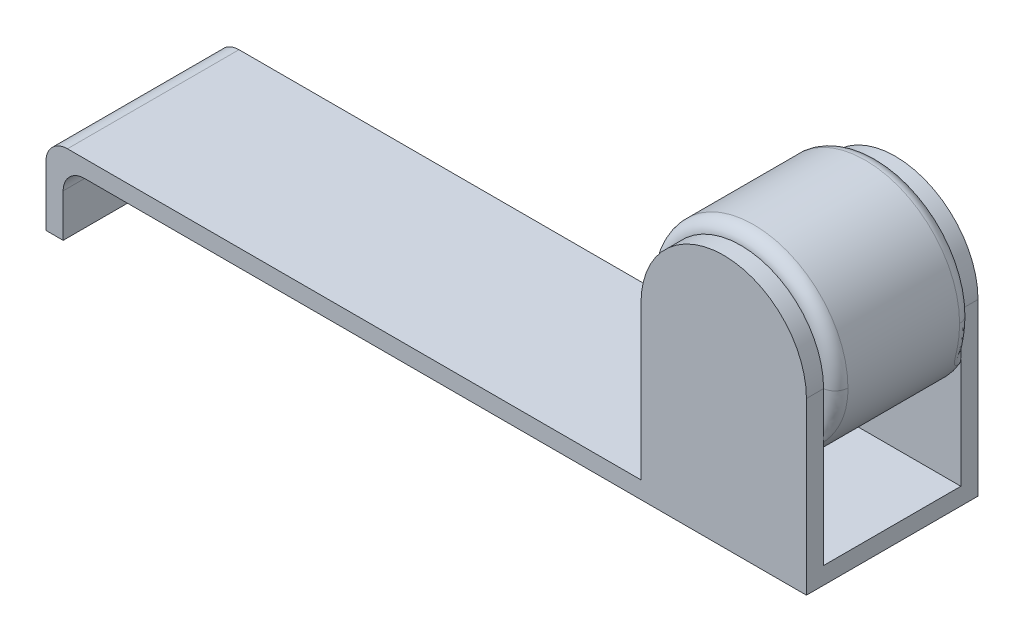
ISO-10303-21;
HEADER;
FILE_DESCRIPTION(('STEP AP214'),'2;1');
FILE_NAME('part.step','',(''),(''),'','','');
FILE_SCHEMA(('AUTOMOTIVE_DESIGN { 1 0 10303 214 1 1 1 1 }'));
ENDSEC;
DATA;
#1=APPLICATION_CONTEXT('core data for automotive mechanical design processes');
#2=APPLICATION_PROTOCOL_DEFINITION('international standard','automotive_design',2000,#1);
#3=PRODUCT_CONTEXT('',#1,'mechanical');
#4=PRODUCT('Part','Part','',(#3));
#5=PRODUCT_RELATED_PRODUCT_CATEGORY('part','',(#4));
#6=PRODUCT_DEFINITION_FORMATION('','',#4);
#7=PRODUCT_DEFINITION_CONTEXT('part definition',#1,'design');
#8=PRODUCT_DEFINITION('design','',#6,#7);
#9=PRODUCT_DEFINITION_SHAPE('','',#8);
#10=(LENGTH_UNIT() NAMED_UNIT(*) SI_UNIT(.MILLI.,.METRE.));
#11=(NAMED_UNIT(*) PLANE_ANGLE_UNIT() SI_UNIT($,.RADIAN.));
#12=(NAMED_UNIT(*) SI_UNIT($,.STERADIAN.) SOLID_ANGLE_UNIT());
#13=UNCERTAINTY_MEASURE_WITH_UNIT(LENGTH_MEASURE(1.E-05),#10,'distance_accuracy_value','');
#14=(GEOMETRIC_REPRESENTATION_CONTEXT(3) GLOBAL_UNCERTAINTY_ASSIGNED_CONTEXT((#13)) GLOBAL_UNIT_ASSIGNED_CONTEXT((#10,
#11,#12)) REPRESENTATION_CONTEXT('',''));
#15=CARTESIAN_POINT('',(0.,0.,0.));
#16=DIRECTION('',(0.,0.,1.));
#17=DIRECTION('',(1.,0.,0.));
#18=AXIS2_PLACEMENT_3D('',#15,#16,#17);
#19=CARTESIAN_POINT('',(-24.3559720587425,0.353975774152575,0.));
#20=DIRECTION('',(-1.,0.,0.));
#21=DIRECTION('',(0.,0.,1.));
#22=AXIS2_PLACEMENT_3D('',#19,#20,#21);
#23=PLANE('',#22);
#24=DIRECTION('',(0.,0.,1.));
#25=VECTOR('',#24,1.);
#26=CARTESIAN_POINT('',(-24.3559720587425,-1.14602422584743,2.));
#27=LINE('',#26,#25);
#28=CARTESIAN_POINT('',(-24.3559720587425,-1.14602422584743,0.));
#29=VERTEX_POINT('',#28);
#30=CARTESIAN_POINT('',(-24.3559720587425,-1.14602422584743,4.));
#31=VERTEX_POINT('',#30);
#32=EDGE_CURVE('E502',#29,#31,#27,.T.);
#33=ORIENTED_EDGE('',*,*,#32,.T.);
#34=DIRECTION('',(0.,1.,0.));
#35=VECTOR('',#34,1.);
#36=CARTESIAN_POINT('',(-24.3559720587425,0.353975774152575,4.));
#37=LINE('',#36,#35);
#38=CARTESIAN_POINT('',(-24.3559720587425,0.253975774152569,4.));
#39=VERTEX_POINT('',#38);
#40=EDGE_CURVE('E463',#31,#39,#37,.T.);
#41=ORIENTED_EDGE('',*,*,#40,.T.);
#42=DIRECTION('',(0.,0.,1.));
#43=VECTOR('',#42,1.);
#44=CARTESIAN_POINT('',(-24.3559720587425,0.253975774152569,0.));
#45=LINE('',#44,#43);
#46=CARTESIAN_POINT('',(-24.3559720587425,0.253975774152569,0.));
#47=VERTEX_POINT('',#46);
#48=EDGE_CURVE('E353',#47,#39,#45,.T.);
#49=ORIENTED_EDGE('',*,*,#48,.F.);
#50=DIRECTION('',(0.,1.,0.));
#51=VECTOR('',#50,1.);
#52=CARTESIAN_POINT('',(-24.3559720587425,0.353975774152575,0.));
#53=LINE('',#52,#51);
#54=EDGE_CURVE('E467',#47,#29,#53,.F.);
#55=ORIENTED_EDGE('',*,*,#54,.T.);
#56=EDGE_LOOP('',(#33,#41,#49,#55));
#57=FACE_BOUND('',#56,.T.);
#58=ADVANCED_FACE('F16',(#57),#23,.T.);
#59=CARTESIAN_POINT('',(-24.1559720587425,-1.14602422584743,2.));
#60=DIRECTION('',(0.,1.,0.));
#61=DIRECTION('',(-1.,0.,0.));
#62=AXIS2_PLACEMENT_3D('',#59,#60,#61);
#63=PLANE('',#62);
#64=DIRECTION('',(-1.,0.,0.));
#65=VECTOR('',#64,1.);
#66=CARTESIAN_POINT('',(-24.1559720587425,-1.14602422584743,4.));
#67=LINE('',#66,#65);
#68=CARTESIAN_POINT('',(-23.9559720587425,-1.14602422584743,4.));
#69=VERTEX_POINT('',#68);
#70=EDGE_CURVE('E499',#31,#69,#67,.F.);
#71=ORIENTED_EDGE('',*,*,#70,.F.);
#72=ORIENTED_EDGE('',*,*,#32,.F.);
#73=DIRECTION('',(-1.,0.,0.));
#74=VECTOR('',#73,1.);
#75=CARTESIAN_POINT('',(-24.1559720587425,-1.14602422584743,0.));
#76=LINE('',#75,#74);
#77=CARTESIAN_POINT('',(-23.9559720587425,-1.14602422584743,0.));
#78=VERTEX_POINT('',#77);
#79=EDGE_CURVE('E466',#78,#29,#76,.T.);
#80=ORIENTED_EDGE('',*,*,#79,.F.);
#81=DIRECTION('',(0.,0.,-1.));
#82=VECTOR('',#81,1.);
#83=CARTESIAN_POINT('',(-23.9559720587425,-1.14602422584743,4.));
#84=LINE('',#83,#82);
#85=EDGE_CURVE('E347',#69,#78,#84,.T.);
#86=ORIENTED_EDGE('',*,*,#85,.F.);
#87=EDGE_LOOP('',(#71,#72,#80,#86));
#88=FACE_BOUND('',#87,.T.);
#89=ADVANCED_FACE('F518',(#88),#63,.F.);
#90=CARTESIAN_POINT('',(-8.55597205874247,4.32548799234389,0.698462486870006));
#91=DIRECTION('',(0.,0.,1.));
#92=DIRECTION('',(-1.,0.,0.));
#93=AXIS2_PLACEMENT_3D('',#90,#91,#92);
#94=TOROIDAL_SURFACE('',#93,1.89815390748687,0.3);
#95=CARTESIAN_POINT('',(-6.3578181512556,4.32548799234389,0.698462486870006));
#96=CARTESIAN_POINT('',(-6.35781807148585,4.32548799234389,0.693870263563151));
#97=CARTESIAN_POINT('',(-6.3579235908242,4.32548799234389,0.689278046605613));
#98=CARTESIAN_POINT('',(-6.35834525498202,4.32548799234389,0.680103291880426));
#99=CARTESIAN_POINT('',(-6.35866139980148,4.32548799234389,0.675520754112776));
#100=CARTESIAN_POINT('',(-6.3595037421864,4.32548799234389,0.666375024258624));
#101=CARTESIAN_POINT('',(-6.36002993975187,4.32548799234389,0.66181183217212));
#102=CARTESIAN_POINT('',(-6.36129125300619,4.32548799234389,0.652714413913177));
#103=CARTESIAN_POINT('',(-6.36202636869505,4.32548799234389,0.648180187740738));
#104=CARTESIAN_POINT('',(-6.36370397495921,4.32548799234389,0.639150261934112));
#105=CARTESIAN_POINT('',(-6.36464646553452,4.32548799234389,0.634654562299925));
#106=CARTESIAN_POINT('',(-6.36673683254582,4.32548799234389,0.625711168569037));
#107=CARTESIAN_POINT('',(-6.36788470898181,4.32548799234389,0.621263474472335));
#108=CARTESIAN_POINT('',(-6.37038342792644,4.32548799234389,0.612425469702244));
#109=CARTESIAN_POINT('',(-6.37173427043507,4.32548799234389,0.608035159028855));
#110=CARTESIAN_POINT('',(-6.37463607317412,4.32548799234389,0.599321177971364));
#111=CARTESIAN_POINT('',(-6.37618703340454,4.32548799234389,0.594997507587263));
#112=CARTESIAN_POINT('',(-6.37948580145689,4.32548799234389,0.586425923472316));
#113=CARTESIAN_POINT('',(-6.38123360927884,4.32548799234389,0.582178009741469));
#114=CARTESIAN_POINT('',(-6.38492238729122,4.32548799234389,0.573766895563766));
#115=CARTESIAN_POINT('',(-6.38686335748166,4.32548799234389,0.569603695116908));
#116=CARTESIAN_POINT('',(-6.39093436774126,4.32548799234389,0.56137078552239));
#117=CARTESIAN_POINT('',(-6.39306440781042,4.32548799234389,0.55730107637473));
#118=CARTESIAN_POINT('',(-6.39750906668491,4.32548799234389,0.549263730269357));
#119=CARTESIAN_POINT('',(-6.39982368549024,4.32548799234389,0.545296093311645));
#120=CARTESIAN_POINT('',(-6.40463262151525,4.32548799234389,0.537471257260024));
#121=CARTESIAN_POINT('',(-6.40712693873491,4.32548799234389,0.533614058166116));
#122=CARTESIAN_POINT('',(-6.41229001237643,4.32548799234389,0.526018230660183));
#123=CARTESIAN_POINT('',(-6.41495876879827,4.32548799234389,0.522279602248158));
#124=CARTESIAN_POINT('',(-6.42046509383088,4.32548799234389,0.514928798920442));
#125=CARTESIAN_POINT('',(-6.42330266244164,4.32548799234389,0.51131662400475));
#126=CARTESIAN_POINT('',(-6.42914062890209,4.32548799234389,0.504226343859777));
#127=CARTESIAN_POINT('',(-6.43214102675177,4.32548799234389,0.500748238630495));
#128=CARTESIAN_POINT('',(-6.43829832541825,4.32548799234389,0.493933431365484));
#129=CARTESIAN_POINT('',(-6.44145522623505,4.32548799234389,0.490596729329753));
#130=CARTESIAN_POINT('',(-6.44791887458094,4.32548799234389,0.484071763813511));
#131=CARTESIAN_POINT('',(-6.45122562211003,4.32548799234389,0.480883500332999));
#132=CARTESIAN_POINT('',(-6.45798199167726,4.32548799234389,0.474662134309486));
#133=CARTESIAN_POINT('',(-6.4614316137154,4.32548799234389,0.471629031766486));
#134=CARTESIAN_POINT('',(-6.46846645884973,4.32548799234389,0.465724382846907));
#135=CARTESIAN_POINT('',(-6.47205168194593,4.32548799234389,0.462852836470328));
#136=CARTESIAN_POINT('',(-6.47935016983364,4.32548799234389,0.457277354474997));
#137=CARTESIAN_POINT('',(-6.48306343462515,4.32548799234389,0.454573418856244));
#138=CARTESIAN_POINT('',(-6.49061017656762,4.32548799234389,0.449338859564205));
#139=CARTESIAN_POINT('',(-6.49444365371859,4.32548799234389,0.44680823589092));
#140=CARTESIAN_POINT('',(-6.50222273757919,4.32548799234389,0.441925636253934));
#141=CARTESIAN_POINT('',(-6.50616834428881,4.32548799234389,0.439573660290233));
#142=CARTESIAN_POINT('',(-6.5141633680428,4.32548799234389,0.435053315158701));
#143=CARTESIAN_POINT('',(-6.51821278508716,4.32548799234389,0.432884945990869));
#144=CARTESIAN_POINT('',(-6.52640689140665,4.32548799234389,0.428736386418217));
#145=CARTESIAN_POINT('',(-6.53055158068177,4.32548799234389,0.426756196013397));
#146=CARTESIAN_POINT('',(-6.53892749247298,4.32548799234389,0.422988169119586));
#147=CARTESIAN_POINT('',(-6.54315871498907,4.32548799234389,0.421200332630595));
#148=CARTESIAN_POINT('',(-6.55169877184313,4.32548799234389,0.417820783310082));
#149=CARTESIAN_POINT('',(-6.55600760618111,4.32548799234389,0.41622907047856));
#150=CARTESIAN_POINT('',(-6.56469380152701,4.32548799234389,0.413245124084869));
#151=CARTESIAN_POINT('',(-6.56907116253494,4.32548799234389,0.4118528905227));
#152=CARTESIAN_POINT('',(-6.577885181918,4.32548799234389,0.409270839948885));
#153=CARTESIAN_POINT('',(-6.58232184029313,4.32548799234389,0.408081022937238));
#154=CARTESIAN_POINT('',(-6.59124509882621,4.32548799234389,0.405906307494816));
#155=CARTESIAN_POINT('',(-6.59573169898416,4.32548799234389,0.404921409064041));
#156=CARTESIAN_POINT('',(-6.60474538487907,4.32548799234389,0.40315863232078));
#157=CARTESIAN_POINT('',(-6.60927247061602,4.32548799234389,0.402380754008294));
#158=CARTESIAN_POINT('',(-6.6183575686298,4.32548799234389,0.40103356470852));
#159=CARTESIAN_POINT('',(-6.62291558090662,4.32548799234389,0.400464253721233));
#160=CARTESIAN_POINT('',(-6.62748427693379,4.32548799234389,0.4));
#161=B_SPLINE_CURVE_WITH_KNOTS('',3,(#95,#96,#97,#98,#99,#100,#101,#102,#103,#104,#105,#106,
#107,#108,#109,#110,#111,#112,#113,#114,#115,#116,#117,#118,#119,#120,#121,#122,#123,#124,#125,
#126,#127,#128,#129,#130,#131,#132,#133,#134,#135,#136,#137,#138,#139,#140,#141,#142,#143,#144,
#145,#146,#147,#148,#149,#150,#151,#152,#153,#154,#155,#156,#157,#158,#159,#160),.UNSPECIFIED.,
.F.,.F.,(4,2,2,2,2,2,2,2,2,2,2,2,2,2,2,2,2,2,2,2,2,2,2,2,2,2,2,2,2,2,2,2,4),(0.,
0.0137754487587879,0.0275508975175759,0.0413263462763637,0.0551017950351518,0.0688772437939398,
0.0826526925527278,0.0964281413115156,0.110203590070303,0.123979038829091,0.13775448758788,
0.151529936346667,0.165305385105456,0.179080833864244,0.192856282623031,0.206631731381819,
0.220407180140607,0.234182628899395,0.247958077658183,0.261733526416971,0.275508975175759,
0.289284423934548,0.303059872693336,0.316835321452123,0.33061077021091,0.344386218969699,
0.358161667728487,0.371937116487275,0.385712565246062,0.39948801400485,0.413263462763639,
0.427038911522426,0.440814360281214),.UNSPECIFIED.);
#162=CARTESIAN_POINT('',(-6.3578181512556,4.32548799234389,0.698462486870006));
#163=VERTEX_POINT('',#162);
#164=CARTESIAN_POINT('',(-6.62748427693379,4.32548799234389,0.4));
#165=VERTEX_POINT('',#164);
#166=EDGE_CURVE('E501',#163,#165,#161,.T.);
#167=ORIENTED_EDGE('',*,*,#166,.T.);
#168=CARTESIAN_POINT('',(-8.55597205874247,4.32548799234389,0.4));
#169=DIRECTION('',(0.,0.,-1.));
#170=DIRECTION('',(-1.,0.,0.));
#171=AXIS2_PLACEMENT_3D('',#168,#169,#170);
#172=CIRCLE('',#171,1.92848778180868);
#173=CARTESIAN_POINT('',(-10.4844598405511,4.32548799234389,0.4));
#174=VERTEX_POINT('',#173);
#175=EDGE_CURVE('E342',#174,#165,#172,.T.);
#176=ORIENTED_EDGE('',*,*,#175,.F.);
#177=CARTESIAN_POINT('',(-10.4844598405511,4.32548799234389,0.4));
#178=CARTESIAN_POINT('',(-10.4890285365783,4.32548799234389,0.400464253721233));
#179=CARTESIAN_POINT('',(-10.4935865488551,4.32548799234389,0.401033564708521));
#180=CARTESIAN_POINT('',(-10.5026716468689,4.32548799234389,0.402380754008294));
#181=CARTESIAN_POINT('',(-10.5071987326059,4.32548799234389,0.403158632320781));
#182=CARTESIAN_POINT('',(-10.5162124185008,4.32548799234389,0.404921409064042));
#183=CARTESIAN_POINT('',(-10.5206990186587,4.32548799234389,0.405906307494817));
#184=CARTESIAN_POINT('',(-10.5296222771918,4.32548799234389,0.408081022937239));
#185=CARTESIAN_POINT('',(-10.5340589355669,4.32548799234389,0.409270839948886));
#186=CARTESIAN_POINT('',(-10.54287295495,4.32548799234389,0.411852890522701));
#187=CARTESIAN_POINT('',(-10.5472503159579,4.32548799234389,0.413245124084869));
#188=CARTESIAN_POINT('',(-10.5559365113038,4.32548799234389,0.41622907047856));
#189=CARTESIAN_POINT('',(-10.5602453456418,4.32548799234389,0.417820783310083));
#190=CARTESIAN_POINT('',(-10.5687854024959,4.32548799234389,0.421200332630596));
#191=CARTESIAN_POINT('',(-10.573016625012,4.32548799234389,0.422988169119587));
#192=CARTESIAN_POINT('',(-10.5813925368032,4.32548799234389,0.426756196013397));
#193=CARTESIAN_POINT('',(-10.5855372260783,4.32548799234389,0.428736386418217));
#194=CARTESIAN_POINT('',(-10.5937313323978,4.32548799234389,0.432884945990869));
#195=CARTESIAN_POINT('',(-10.5977807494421,4.32548799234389,0.435053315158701));
#196=CARTESIAN_POINT('',(-10.6057757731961,4.32548799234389,0.439573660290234));
#197=CARTESIAN_POINT('',(-10.6097213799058,4.32548799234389,0.441925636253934));
#198=CARTESIAN_POINT('',(-10.6175004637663,4.32548799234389,0.44680823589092));
#199=CARTESIAN_POINT('',(-10.6213339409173,4.32548799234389,0.449338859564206));
#200=CARTESIAN_POINT('',(-10.6288806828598,4.32548799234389,0.454573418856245));
#201=CARTESIAN_POINT('',(-10.6325939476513,4.32548799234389,0.457277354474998));
#202=CARTESIAN_POINT('',(-10.639892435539,4.32548799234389,0.462852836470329));
#203=CARTESIAN_POINT('',(-10.6434776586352,4.32548799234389,0.465724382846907));
#204=CARTESIAN_POINT('',(-10.6505125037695,4.32548799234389,0.471629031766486));
#205=CARTESIAN_POINT('',(-10.6539621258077,4.32548799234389,0.474662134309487));
#206=CARTESIAN_POINT('',(-10.6607184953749,4.32548799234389,0.480883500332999));
#207=CARTESIAN_POINT('',(-10.664025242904,4.32548799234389,0.484071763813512));
#208=CARTESIAN_POINT('',(-10.6704888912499,4.32548799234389,0.490596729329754));
#209=CARTESIAN_POINT('',(-10.6736457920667,4.32548799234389,0.493933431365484));
#210=CARTESIAN_POINT('',(-10.6798030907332,4.32548799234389,0.500748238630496));
#211=CARTESIAN_POINT('',(-10.6828034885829,4.32548799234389,0.504226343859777));
#212=CARTESIAN_POINT('',(-10.6886414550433,4.32548799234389,0.51131662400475));
#213=CARTESIAN_POINT('',(-10.6914790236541,4.32548799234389,0.514928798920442));
#214=CARTESIAN_POINT('',(-10.6969853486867,4.32548799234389,0.522279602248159));
#215=CARTESIAN_POINT('',(-10.6996541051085,4.32548799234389,0.526018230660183));
#216=CARTESIAN_POINT('',(-10.70481717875,4.32548799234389,0.533614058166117));
#217=CARTESIAN_POINT('',(-10.7073114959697,4.32548799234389,0.537471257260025));
#218=CARTESIAN_POINT('',(-10.7121204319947,4.32548799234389,0.545296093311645));
#219=CARTESIAN_POINT('',(-10.7144350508,4.32548799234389,0.549263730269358));
#220=CARTESIAN_POINT('',(-10.7188797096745,4.32548799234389,0.557301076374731));
#221=CARTESIAN_POINT('',(-10.7210097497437,4.32548799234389,0.561370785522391));
#222=CARTESIAN_POINT('',(-10.7250807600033,4.32548799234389,0.569603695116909));
#223=CARTESIAN_POINT('',(-10.7270217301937,4.32548799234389,0.573766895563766));
#224=CARTESIAN_POINT('',(-10.7307105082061,4.32548799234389,0.58217800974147));
#225=CARTESIAN_POINT('',(-10.732458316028,4.32548799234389,0.586425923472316));
#226=CARTESIAN_POINT('',(-10.7357570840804,4.32548799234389,0.594997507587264));
#227=CARTESIAN_POINT('',(-10.7373080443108,4.32548799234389,0.599321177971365));
#228=CARTESIAN_POINT('',(-10.7402098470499,4.32548799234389,0.608035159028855));
#229=CARTESIAN_POINT('',(-10.7415606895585,4.32548799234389,0.612425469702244));
#230=CARTESIAN_POINT('',(-10.7440594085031,4.32548799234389,0.621263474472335));
#231=CARTESIAN_POINT('',(-10.7452072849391,4.32548799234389,0.625711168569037));
#232=CARTESIAN_POINT('',(-10.7472976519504,4.32548799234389,0.634654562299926));
#233=CARTESIAN_POINT('',(-10.7482401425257,4.32548799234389,0.639150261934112));
#234=CARTESIAN_POINT('',(-10.7499177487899,4.32548799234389,0.648180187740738));
#235=CARTESIAN_POINT('',(-10.7506528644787,4.32548799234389,0.652714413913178));
#236=CARTESIAN_POINT('',(-10.7519141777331,4.32548799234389,0.661811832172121));
#237=CARTESIAN_POINT('',(-10.7524403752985,4.32548799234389,0.666375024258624));
#238=CARTESIAN_POINT('',(-10.7532827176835,4.32548799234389,0.675520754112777));
#239=CARTESIAN_POINT('',(-10.7535988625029,4.32548799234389,0.680103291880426));
#240=CARTESIAN_POINT('',(-10.7540205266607,4.32548799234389,0.689278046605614));
#241=CARTESIAN_POINT('',(-10.7541260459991,4.32548799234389,0.693870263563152));
#242=CARTESIAN_POINT('',(-10.7541259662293,4.32548799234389,0.698462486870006));
#243=B_SPLINE_CURVE_WITH_KNOTS('',3,(#177,#178,#179,#180,#181,#182,#183,#184,#185,#186,#187,
#188,#189,#190,#191,#192,#193,#194,#195,#196,#197,#198,#199,#200,#201,#202,#203,#204,#205,#206,
#207,#208,#209,#210,#211,#212,#213,#214,#215,#216,#217,#218,#219,#220,#221,#222,#223,#224,#225,
#226,#227,#228,#229,#230,#231,#232,#233,#234,#235,#236,#237,#238,#239,#240,#241,#242),
.UNSPECIFIED.,.F.,.F.,(4,2,2,2,2,2,2,2,2,2,2,2,2,2,2,2,2,2,2,2,2,2,2,2,2,2,2,2,2,2,2,2,4),(0.,
0.0137754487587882,0.027550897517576,0.0413263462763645,0.0551017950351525,0.0688772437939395,
0.0826526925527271,0.0964281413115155,0.110203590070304,0.123979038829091,0.137754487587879,
0.151529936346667,0.165305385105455,0.179080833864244,0.192856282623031,0.20663173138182,
0.220407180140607,0.234182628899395,0.247958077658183,0.261733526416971,0.275508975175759,
0.289284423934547,0.303059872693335,0.316835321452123,0.330610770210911,0.344386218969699,
0.358161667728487,0.371937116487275,0.385712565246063,0.399488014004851,0.413263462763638,
0.427038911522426,0.440814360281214),.UNSPECIFIED.);
#244=CARTESIAN_POINT('',(-10.7541259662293,4.32548799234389,0.698462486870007));
#245=VERTEX_POINT('',#244);
#246=EDGE_CURVE('E712',#174,#245,#243,.T.);
#247=ORIENTED_EDGE('',*,*,#246,.T.);
#248=CARTESIAN_POINT('',(-8.55597205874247,4.32548799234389,0.698462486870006));
#249=DIRECTION('',(0.,0.,-1.));
#250=DIRECTION('',(-1.,0.,0.));
#251=AXIS2_PLACEMENT_3D('',#248,#249,#250);
#252=CIRCLE('',#251,2.19815390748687);
#253=EDGE_CURVE('E407',#163,#245,#252,.F.);
#254=ORIENTED_EDGE('',*,*,#253,.F.);
#255=EDGE_LOOP('',(#167,#176,#247,#254));
#256=FACE_BOUND('',#255,.T.);
#257=ADVANCED_FACE('F514',(#256),#94,.T.);
#258=CARTESIAN_POINT('',(-10.4844598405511,4.32548799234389,0.4));
#259=CARTESIAN_POINT('',(-10.4844598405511,4.16245305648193,0.4));
#260=CARTESIAN_POINT('',(-10.4844598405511,3.88827792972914,0.4));
#261=CARTESIAN_POINT('',(-10.4844598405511,3.58145282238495,0.4));
#262=CARTESIAN_POINT('',(-10.4844598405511,3.42626947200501,0.4));
#263=CARTESIAN_POINT('',(-10.4844598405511,3.36345910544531,0.4));
#264=CARTESIAN_POINT('',(-10.4844598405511,3.35028760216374,0.4));
#265=CARTESIAN_POINT('',(-10.4844588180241,3.35028390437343,0.399998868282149));
#266=CARTESIAN_POINT('',(-10.5575587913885,4.32548799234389,0.407429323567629));
#267=CARTESIAN_POINT('',(-10.5575587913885,4.15610192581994,0.407429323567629));
#268=CARTESIAN_POINT('',(-10.5500562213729,3.8716977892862,0.416783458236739));
#269=CARTESIAN_POINT('',(-10.5206751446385,3.55816305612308,0.429082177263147));
#270=CARTESIAN_POINT('',(-10.4976251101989,3.40040239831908,0.423237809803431));
#271=CARTESIAN_POINT('',(-10.486853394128,3.33667107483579,0.412233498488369));
#272=CARTESIAN_POINT('',(-10.4844598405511,3.32330936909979,0.404118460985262));
#273=CARTESIAN_POINT('',(-10.4844598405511,3.32330936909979,0.4));
#274=CARTESIAN_POINT('',(-10.6975777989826,4.32548799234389,0.478499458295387));
#275=CARTESIAN_POINT('',(-10.6975777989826,4.14348017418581,0.478499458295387));
#276=CARTESIAN_POINT('',(-10.6675598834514,3.83869414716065,0.496047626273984));
#277=CARTESIAN_POINT('',(-10.5765425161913,3.51162587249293,0.506158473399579));
#278=CARTESIAN_POINT('',(-10.5125377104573,3.34868132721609,0.476215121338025));
#279=CARTESIAN_POINT('',(-10.4835103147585,3.28309838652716,0.438671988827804));
#280=CARTESIAN_POINT('',(-10.4771363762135,3.26935557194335,0.41302690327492));
#281=CARTESIAN_POINT('',(-10.4771363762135,3.26935557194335,0.4));
#282=CARTESIAN_POINT('',(-10.7541259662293,4.32548799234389,0.624986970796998));
#283=CARTESIAN_POINT('',(-10.7541259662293,4.13728686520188,0.624986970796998));
#284=CARTESIAN_POINT('',(-10.71297827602,3.82144019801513,0.631005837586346));
#285=CARTESIAN_POINT('',(-10.5892511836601,3.47635188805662,0.604352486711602));
#286=CARTESIAN_POINT('',(-10.5032275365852,3.30357514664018,0.53618095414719));
#287=CARTESIAN_POINT('',(-10.464223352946,3.23390239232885,0.467245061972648));
#288=CARTESIAN_POINT('',(-10.4556999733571,3.21930433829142,0.422628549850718));
#289=CARTESIAN_POINT('',(-10.4556999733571,3.21930433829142,0.4));
#290=CARTESIAN_POINT('',(-10.7541259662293,4.32548799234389,0.698462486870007));
#291=CARTESIAN_POINT('',(-10.7541259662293,4.13668566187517,0.698462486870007));
#292=CARTESIAN_POINT('',(-10.713059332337,3.81917762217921,0.698630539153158));
#293=CARTESIAN_POINT('',(-10.5845595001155,3.46385932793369,0.653427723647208));
#294=CARTESIAN_POINT('',(-10.4928979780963,3.2841495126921,0.566158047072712));
#295=CARTESIAN_POINT('',(-10.4510449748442,3.21141207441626,0.481522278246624));
#296=CARTESIAN_POINT('',(-10.4418395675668,3.19615883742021,0.427429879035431));
#297=CARTESIAN_POINT('',(-10.4418395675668,3.19615883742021,0.4));
#298=B_SPLINE_SURFACE_WITH_KNOTS('',3,3,((#258,#259,#260,#261,#262,#263,#264,#265),(#266,#267,
#268,#269,#270,#271,#272,#273),(#274,#275,#276,#277,#278,#279,#280,#281),(#282,#283,#284,#285,
#286,#287,#288,#289),(#290,#291,#292,#293,#294,#295,#296,#297)),.UNSPECIFIED.,.F.,.F.,.F.,(4,1,
4),(4,1,1,1,1,4),(0.,0.5,1.),(0.,0.0489104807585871,0.0815174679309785,0.0978209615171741,
0.105972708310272,0.11412445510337),.UNSPECIFIED.);
#299=CARTESIAN_POINT('',(-10.4418395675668,3.19615883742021,0.4));
#300=CARTESIAN_POINT('',(-10.4418395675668,3.19615883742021,0.427429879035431));
#301=CARTESIAN_POINT('',(-10.4510449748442,3.21141207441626,0.481522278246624));
#302=CARTESIAN_POINT('',(-10.4928979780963,3.2841495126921,0.566158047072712));
#303=CARTESIAN_POINT('',(-10.5845595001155,3.46385932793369,0.653427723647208));
#304=CARTESIAN_POINT('',(-10.713059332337,3.81917762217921,0.698630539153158));
#305=CARTESIAN_POINT('',(-10.7541259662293,4.13668566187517,0.698462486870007));
#306=CARTESIAN_POINT('',(-10.7541259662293,4.32548799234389,0.698462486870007));
#307=B_SPLINE_CURVE_WITH_KNOTS('',3,(#299,#300,#301,#302,#303,#304,#305,#306),.UNSPECIFIED.,.F.,
.F.,(4,1,1,1,1,4),(0.,0.00815174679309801,0.0163034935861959,0.0326069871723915,
0.0652139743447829,0.11412445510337),.UNSPECIFIED.);
#308=CARTESIAN_POINT('',(-10.4418395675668,3.19615883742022,0.4));
#309=VERTEX_POINT('',#308);
#310=EDGE_CURVE('E677',#245,#309,#307,.F.);
#311=DIRECTION('',(0.,1.,0.));
#312=VECTOR('',#311,1.);
#313=CARTESIAN_POINT('',(-10.4844598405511,0.753975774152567,0.4));
#314=LINE('',#313,#312);
#315=CARTESIAN_POINT('',(-10.4844595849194,3.35028667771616,0.399999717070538));
#316=VERTEX_POINT('',#315);
#317=EDGE_CURVE('E337',#316,#174,#314,.T.);
#318=CARTESIAN_POINT('',(-10.4844588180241,3.35028390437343,0.399998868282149));
#319=CARTESIAN_POINT('',(-10.4844598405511,3.32330936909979,0.4));
#320=CARTESIAN_POINT('',(-10.4771363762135,3.26935557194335,0.4));
#321=CARTESIAN_POINT('',(-10.4556999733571,3.21930433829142,0.4));
#322=CARTESIAN_POINT('',(-10.4418395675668,3.19615883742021,0.4));
#323=B_SPLINE_CURVE_WITH_KNOTS('',3,(#318,#319,#320,#321,#322),.UNSPECIFIED.,.F.,.F.,(4,1,4),
(0.,0.5,1.),.UNSPECIFIED.);
#324=EDGE_CURVE('E302',#309,#316,#323,.F.);
#325=ORIENTED_EDGE('',*,*,#310,.F.);
#326=ORIENTED_EDGE('',*,*,#246,.F.);
#327=ORIENTED_EDGE('',*,*,#317,.F.);
#328=ORIENTED_EDGE('',*,*,#324,.F.);
#329=EDGE_LOOP('',(#325,#326,#327,#328));
#330=FACE_BOUND('',#329,.T.);
#331=ADVANCED_FACE('F430',(#330),#298,.F.);
#332=CARTESIAN_POINT('',(-8.55597205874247,4.32548799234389,3.6));
#333=DIRECTION('',(0.,0.,-1.));
#334=DIRECTION('',(-1.,0.,0.));
#335=AXIS2_PLACEMENT_3D('',#332,#333,#334);
#336=CYLINDRICAL_SURFACE('',#335,2.19815390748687);
#337=CARTESIAN_POINT('',(-6.3578181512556,4.32548799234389,0.698462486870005));
#338=CARTESIAN_POINT('',(-6.3578181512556,4.19916997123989,0.698462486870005));
#339=CARTESIAN_POINT('',(-6.38007342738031,3.944832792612,0.697168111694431));
#340=CARTESIAN_POINT('',(-6.46829032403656,3.61055981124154,0.678796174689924));
#341=CARTESIAN_POINT('',(-6.56760013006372,3.38278757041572,0.620954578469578));
#342=CARTESIAN_POINT('',(-6.64202324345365,3.24248985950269,0.530137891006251));
#343=CARTESIAN_POINT('',(-6.67010454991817,3.19615883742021,0.454899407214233));
#344=CARTESIAN_POINT('',(-6.67010454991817,3.19615883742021,0.399999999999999));
#345=B_SPLINE_CURVE_WITH_KNOTS('',3,(#337,#338,#339,#340,#341,#342,#343,#344),.UNSPECIFIED.,.F.,
.F.,(4,1,1,1,1,4),(-0.0644807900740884,-0.0318637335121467,0.000753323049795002,
0.0252161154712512,0.0333703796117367,0.0496789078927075),.UNSPECIFIED.);
#346=CARTESIAN_POINT('',(-6.67010454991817,3.19615883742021,0.4));
#347=VERTEX_POINT('',#346);
#348=EDGE_CURVE('E632',#347,#163,#345,.F.);
#349=ORIENTED_EDGE('',*,*,#348,.T.);
#350=ORIENTED_EDGE('',*,*,#253,.T.);
#351=ORIENTED_EDGE('',*,*,#310,.T.);
#352=CARTESIAN_POINT('',(-6.67010454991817,3.19615883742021,0.4));
#353=CARTESIAN_POINT('',(-6.81385960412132,2.95610217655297,0.4));
#354=CARTESIAN_POINT('',(-7.01352928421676,2.75936191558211,0.4));
#355=CARTESIAN_POINT('',(-7.21959595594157,2.55631851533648,0.4));
#356=CARTESIAN_POINT('',(-7.47212675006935,2.41311774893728,0.4));
#357=CARTESIAN_POINT('',(-7.72377494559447,2.27041747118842,0.4));
#358=CARTESIAN_POINT('',(-8.00479105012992,2.19755939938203,0.4));
#359=CARTESIAN_POINT('',(-8.27539551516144,2.12740071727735,0.4));
#360=CARTESIAN_POINT('',(-8.55597205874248,2.12733408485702,0.4));
#361=CARTESIAN_POINT('',(-8.83552386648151,2.12726769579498,0.4));
#362=CARTESIAN_POINT('',(-9.10715306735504,2.19755939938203,0.4));
#363=CARTESIAN_POINT('',(-9.38721992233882,2.27003458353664,0.4));
#364=CARTESIAN_POINT('',(-9.63981736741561,2.41311774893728,0.400000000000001));
#365=CARTESIAN_POINT('',(-9.89153198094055,2.55570083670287,0.400000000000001));
#366=CARTESIAN_POINT('',(-10.0984148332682,2.75936191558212,0.400000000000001));
#367=CARTESIAN_POINT('',(-10.2978218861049,2.95566361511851,0.400000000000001));
#368=CARTESIAN_POINT('',(-10.4418395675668,3.19615883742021,0.400000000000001));
#369=B_SPLINE_CURVE_WITH_KNOTS('',2,(#352,#353,#354,#355,#356,#357,#358,#359,#360,#361,#362,
#363,#364,#365,#366,#367,#368),.UNSPECIFIED.,.F.,.F.,(3,2,2,2,2,2,2,2,3),(0.,0.125,0.25,0.375,
0.5,0.625,0.75,0.875,1.),.UNSPECIFIED.);
#370=EDGE_CURVE('E291',#347,#309,#369,.T.);
#371=ORIENTED_EDGE('',*,*,#370,.F.);
#372=EDGE_LOOP('',(#349,#350,#351,#371));
#373=FACE_BOUND('',#372,.T.);
#374=CARTESIAN_POINT('',(-8.55597205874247,4.32548799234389,3.30153751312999));
#375=DIRECTION('',(0.,0.,-1.));
#376=DIRECTION('',(0.247667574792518,-0.968845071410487,0.));
#377=AXIS2_PLACEMENT_3D('',#374,#375,#376);
#378=CIRCLE('',#377,2.19815390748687);
#379=CARTESIAN_POINT('',(-6.3578181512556,4.32548799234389,3.30153751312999));
#380=VERTEX_POINT('',#379);
#381=CARTESIAN_POINT('',(-10.7541259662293,4.32548799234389,3.30153751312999));
#382=VERTEX_POINT('',#381);
#383=EDGE_CURVE('E398',#380,#382,#378,.F.);
#384=ORIENTED_EDGE('',*,*,#383,.F.);
#385=CARTESIAN_POINT('',(-6.67010454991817,3.19615883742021,3.6));
#386=CARTESIAN_POINT('',(-6.67010454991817,3.19615883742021,3.57257282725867));
#387=CARTESIAN_POINT('',(-6.66090095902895,3.21140928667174,3.51847753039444));
#388=CARTESIAN_POINT('',(-6.6190494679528,3.28414304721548,3.43384694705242));
#389=CARTESIAN_POINT('',(-6.52738262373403,3.46386480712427,3.3465651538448));
#390=CARTESIAN_POINT('',(-6.39888806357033,3.81916012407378,3.30137036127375));
#391=CARTESIAN_POINT('',(-6.3578181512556,4.13668878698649,3.30153751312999));
#392=CARTESIAN_POINT('',(-6.3578181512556,4.32548799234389,3.30153751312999));
#393=B_SPLINE_CURVE_WITH_KNOTS('',3,(#385,#386,#387,#388,#389,#390,#391,#392),.UNSPECIFIED.,.F.,
.F.,(4,1,1,1,1,4),(0.,0.00815161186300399,0.0163032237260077,0.0326064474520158,
0.0652128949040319,0.114122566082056),.UNSPECIFIED.);
#394=CARTESIAN_POINT('',(-6.67010454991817,3.19615883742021,3.6));
#395=VERTEX_POINT('',#394);
#396=EDGE_CURVE('E575',#380,#395,#393,.F.);
#397=ORIENTED_EDGE('',*,*,#396,.T.);
#398=CARTESIAN_POINT('',(-10.4418395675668,3.19615883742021,3.6));
#399=CARTESIAN_POINT('',(-10.2980845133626,2.95610217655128,3.6));
#400=CARTESIAN_POINT('',(-10.0984148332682,2.75936191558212,3.6));
#401=CARTESIAN_POINT('',(-9.89234816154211,2.55631851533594,3.6));
#402=CARTESIAN_POINT('',(-9.63981736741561,2.41311774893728,3.6));
#403=CARTESIAN_POINT('',(-9.38816917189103,2.27041747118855,3.6));
#404=CARTESIAN_POINT('',(-9.10715306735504,2.19755939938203,3.6));
#405=CARTESIAN_POINT('',(-8.83654860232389,2.12740071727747,3.6));
#406=CARTESIAN_POINT('',(-8.55597205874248,2.12733408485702,3.6));
#407=CARTESIAN_POINT('',(-8.27642025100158,2.12726769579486,3.6));
#408=CARTESIAN_POINT('',(-8.00479105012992,2.19755939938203,3.6));
#409=CARTESIAN_POINT('',(-7.72472419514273,2.27003458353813,3.6));
#410=CARTESIAN_POINT('',(-7.47212675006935,2.41311774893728,3.6));
#411=CARTESIAN_POINT('',(-7.22041213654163,2.55570083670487,3.6));
#412=CARTESIAN_POINT('',(-7.01352928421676,2.75936191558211,3.6));
#413=CARTESIAN_POINT('',(-6.81412223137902,2.95566361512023,3.6));
#414=CARTESIAN_POINT('',(-6.67010454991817,3.19615883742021,3.6));
#415=B_SPLINE_CURVE_WITH_KNOTS('',2,(#398,#399,#400,#401,#402,#403,#404,#405,#406,#407,#408,
#409,#410,#411,#412,#413,#414),.UNSPECIFIED.,.F.,.F.,(3,2,2,2,2,2,2,2,3),(0.,0.125,0.25,0.375,
0.5,0.625,0.75,0.875,1.),.UNSPECIFIED.);
#416=CARTESIAN_POINT('',(-10.4418395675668,3.19615883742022,3.6));
#417=VERTEX_POINT('',#416);
#418=EDGE_CURVE('E568',#417,#395,#415,.T.);
#419=ORIENTED_EDGE('',*,*,#418,.F.);
#420=CARTESIAN_POINT('',(-10.7541259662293,4.32548799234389,3.30153751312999));
#421=CARTESIAN_POINT('',(-10.7541259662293,4.19949380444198,3.30153751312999));
#422=CARTESIAN_POINT('',(-10.7325520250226,3.94649578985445,3.30298602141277));
#423=CARTESIAN_POINT('',(-10.6509370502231,3.63975920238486,3.31953693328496));
#424=CARTESIAN_POINT('',(-10.558198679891,3.41210960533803,3.37113831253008));
#425=CARTESIAN_POINT('',(-10.4930160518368,3.28431817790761,3.43416208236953));
#426=CARTESIAN_POINT('',(-10.4509767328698,3.21127537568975,3.51856750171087));
#427=CARTESIAN_POINT('',(-10.4418395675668,3.19615883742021,3.57257356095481));
#428=CARTESIAN_POINT('',(-10.4418395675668,3.19615883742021,3.6));
#429=B_SPLINE_CURVE_WITH_KNOTS('',3,(#420,#421,#422,#423,#424,#425,#426,#427,#428),
.UNSPECIFIED.,.F.,.F.,(4,1,1,1,1,1,4),(-0.114238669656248,-0.0815990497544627,
-0.0489594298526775,-0.0326396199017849,-0.0163198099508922,-0.008159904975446,0.),.UNSPECIFIED.);
#430=EDGE_CURVE('E406',#417,#382,#429,.F.);
#431=ORIENTED_EDGE('',*,*,#430,.T.);
#432=EDGE_LOOP('',(#384,#397,#419,#431));
#433=FACE_BOUND('',#432,.T.);
#434=ADVANCED_FACE('F378',(#373,#433),#336,.T.);
#435=CARTESIAN_POINT('',(-8.55597205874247,4.32548799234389,3.30153751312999));
#436=DIRECTION('',(0.,0.,-1.));
#437=DIRECTION('',(0.247667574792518,-0.968845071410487,0.));
#438=AXIS2_PLACEMENT_3D('',#435,#436,#437);
#439=TOROIDAL_SURFACE('',#438,1.89815390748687,0.3);
#440=CARTESIAN_POINT('',(-6.62748427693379,4.32548799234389,3.6));
#441=CARTESIAN_POINT('',(-6.62291558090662,4.32548799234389,3.59953574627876));
#442=CARTESIAN_POINT('',(-6.6183575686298,4.32548799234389,3.59896643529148));
#443=CARTESIAN_POINT('',(-6.60927247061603,4.32548799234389,3.5976192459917));
#444=CARTESIAN_POINT('',(-6.60474538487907,4.32548799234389,3.59684136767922));
#445=CARTESIAN_POINT('',(-6.59573169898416,4.32548799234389,3.59507859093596));
#446=CARTESIAN_POINT('',(-6.59124509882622,4.32548799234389,3.59409369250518));
#447=CARTESIAN_POINT('',(-6.58232184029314,4.32548799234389,3.59191897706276));
#448=CARTESIAN_POINT('',(-6.57788518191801,4.32548799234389,3.59072916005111));
#449=CARTESIAN_POINT('',(-6.56907116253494,4.32548799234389,3.5881471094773));
#450=CARTESIAN_POINT('',(-6.56469380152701,4.32548799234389,3.58675487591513));
#451=CARTESIAN_POINT('',(-6.55600760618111,4.32548799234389,3.58377092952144));
#452=CARTESIAN_POINT('',(-6.55169877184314,4.32548799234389,3.58217921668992));
#453=CARTESIAN_POINT('',(-6.54315871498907,4.32548799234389,3.5787996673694));
#454=CARTESIAN_POINT('',(-6.53892749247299,4.32548799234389,3.57701183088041));
#455=CARTESIAN_POINT('',(-6.53055158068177,4.32548799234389,3.5732438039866));
#456=CARTESIAN_POINT('',(-6.52640689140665,4.32548799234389,3.57126361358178));
#457=CARTESIAN_POINT('',(-6.51821278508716,4.32548799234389,3.56711505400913));
#458=CARTESIAN_POINT('',(-6.5141633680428,4.32548799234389,3.5649466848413));
#459=CARTESIAN_POINT('',(-6.50616834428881,4.32548799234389,3.56042633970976));
#460=CARTESIAN_POINT('',(-6.50222273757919,4.32548799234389,3.55807436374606));
#461=CARTESIAN_POINT('',(-6.49444365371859,4.32548799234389,3.55319176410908));
#462=CARTESIAN_POINT('',(-6.49061017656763,4.32548799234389,3.55066114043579));
#463=CARTESIAN_POINT('',(-6.48306343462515,4.32548799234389,3.54542658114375));
#464=CARTESIAN_POINT('',(-6.47935016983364,4.32548799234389,3.542722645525));
#465=CARTESIAN_POINT('',(-6.47205168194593,4.32548799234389,3.53714716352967));
#466=CARTESIAN_POINT('',(-6.46846645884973,4.32548799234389,3.53427561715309));
#467=CARTESIAN_POINT('',(-6.4614316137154,4.32548799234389,3.52837096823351));
#468=CARTESIAN_POINT('',(-6.45798199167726,4.32548799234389,3.52533786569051));
#469=CARTESIAN_POINT('',(-6.45122562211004,4.32548799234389,3.519116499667));
#470=CARTESIAN_POINT('',(-6.44791887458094,4.32548799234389,3.51592823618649));
#471=CARTESIAN_POINT('',(-6.44145522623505,4.32548799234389,3.50940327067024));
#472=CARTESIAN_POINT('',(-6.43829832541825,4.32548799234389,3.50606656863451));
#473=CARTESIAN_POINT('',(-6.43214102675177,4.32548799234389,3.4992517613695));
#474=CARTESIAN_POINT('',(-6.42914062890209,4.32548799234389,3.49577365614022));
#475=CARTESIAN_POINT('',(-6.42330266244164,4.32548799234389,3.48868337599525));
#476=CARTESIAN_POINT('',(-6.42046509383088,4.32548799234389,3.48507120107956));
#477=CARTESIAN_POINT('',(-6.41495876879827,4.32548799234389,3.47772039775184));
#478=CARTESIAN_POINT('',(-6.41229001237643,4.32548799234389,3.47398176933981));
#479=CARTESIAN_POINT('',(-6.40712693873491,4.32548799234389,3.46638594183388));
#480=CARTESIAN_POINT('',(-6.40463262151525,4.32548799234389,3.46252874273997));
#481=CARTESIAN_POINT('',(-6.39982368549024,4.32548799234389,3.45470390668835));
#482=CARTESIAN_POINT('',(-6.39750906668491,4.32548799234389,3.45073626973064));
#483=CARTESIAN_POINT('',(-6.39306440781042,4.32548799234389,3.44269892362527));
#484=CARTESIAN_POINT('',(-6.39093436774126,4.32548799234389,3.43862921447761));
#485=CARTESIAN_POINT('',(-6.38686335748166,4.32548799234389,3.43039630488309));
#486=CARTESIAN_POINT('',(-6.38492238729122,4.32548799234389,3.42623310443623));
#487=CARTESIAN_POINT('',(-6.38123360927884,4.32548799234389,3.41782199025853));
#488=CARTESIAN_POINT('',(-6.37948580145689,4.32548799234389,3.41357407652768));
#489=CARTESIAN_POINT('',(-6.37618703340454,4.32548799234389,3.40500249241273));
#490=CARTESIAN_POINT('',(-6.37463607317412,4.32548799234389,3.40067882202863));
#491=CARTESIAN_POINT('',(-6.37173427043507,4.32548799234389,3.39196484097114));
#492=CARTESIAN_POINT('',(-6.37038342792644,4.32548799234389,3.38757453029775));
#493=CARTESIAN_POINT('',(-6.36788470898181,4.32548799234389,3.37873652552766));
#494=CARTESIAN_POINT('',(-6.36673683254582,4.32548799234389,3.37428883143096));
#495=CARTESIAN_POINT('',(-6.36464646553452,4.32548799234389,3.36534543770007));
#496=CARTESIAN_POINT('',(-6.36370397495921,4.32548799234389,3.36084973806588));
#497=CARTESIAN_POINT('',(-6.36202636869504,4.32548799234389,3.35181981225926));
#498=CARTESIAN_POINT('',(-6.36129125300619,4.32548799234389,3.34728558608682));
#499=CARTESIAN_POINT('',(-6.36002993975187,4.32548799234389,3.33818816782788));
#500=CARTESIAN_POINT('',(-6.3595037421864,4.32548799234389,3.33362497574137));
#501=CARTESIAN_POINT('',(-6.35866139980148,4.32548799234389,3.32447924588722));
#502=CARTESIAN_POINT('',(-6.35834525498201,4.32548799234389,3.31989670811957));
#503=CARTESIAN_POINT('',(-6.3579235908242,4.32548799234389,3.31072195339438));
#504=CARTESIAN_POINT('',(-6.35781807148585,4.32548799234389,3.30612973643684));
#505=CARTESIAN_POINT('',(-6.3578181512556,4.32548799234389,3.30153751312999));
#506=B_SPLINE_CURVE_WITH_KNOTS('',3,(#440,#441,#442,#443,#444,#445,#446,#447,#448,#449,#450,
#451,#452,#453,#454,#455,#456,#457,#458,#459,#460,#461,#462,#463,#464,#465,#466,#467,#468,#469,
#470,#471,#472,#473,#474,#475,#476,#477,#478,#479,#480,#481,#482,#483,#484,#485,#486,#487,#488,
#489,#490,#491,#492,#493,#494,#495,#496,#497,#498,#499,#500,#501,#502,#503,#504,#505),
.UNSPECIFIED.,.F.,.F.,(4,2,2,2,2,2,2,2,2,2,2,2,2,2,2,2,2,2,2,2,2,2,2,2,2,2,2,2,2,2,2,2,4),(0.,
0.0137754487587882,0.0275508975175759,0.0413263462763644,0.0551017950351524,0.0688772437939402,
0.0826526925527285,0.0964281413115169,0.110203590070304,0.123979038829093,0.13775448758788,
0.151529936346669,0.165305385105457,0.179080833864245,0.192856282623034,0.206631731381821,
0.220407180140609,0.234182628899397,0.247958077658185,0.261733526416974,0.275508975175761,
0.289284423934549,0.303059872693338,0.316835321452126,0.330610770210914,0.344386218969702,
0.35816166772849,0.371937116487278,0.385712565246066,0.399488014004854,0.413263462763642,
0.42703891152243,0.440814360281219),.UNSPECIFIED.);
#507=CARTESIAN_POINT('',(-6.62748427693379,4.32548799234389,3.6));
#508=VERTEX_POINT('',#507);
#509=EDGE_CURVE('E560',#508,#380,#506,.T.);
#510=ORIENTED_EDGE('',*,*,#509,.T.);
#511=ORIENTED_EDGE('',*,*,#383,.T.);
#512=CARTESIAN_POINT('',(-10.7541259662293,4.32548799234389,3.30153751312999));
#513=CARTESIAN_POINT('',(-10.7541260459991,4.32548799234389,3.30612973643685));
#514=CARTESIAN_POINT('',(-10.7540205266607,4.32548799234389,3.31072195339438));
#515=CARTESIAN_POINT('',(-10.7535988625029,4.32548799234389,3.31989670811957));
#516=CARTESIAN_POINT('',(-10.7532827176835,4.32548799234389,3.32447924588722));
#517=CARTESIAN_POINT('',(-10.7524403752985,4.32548799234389,3.33362497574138));
#518=CARTESIAN_POINT('',(-10.7519141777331,4.32548799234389,3.33818816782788));
#519=CARTESIAN_POINT('',(-10.7506528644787,4.32548799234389,3.34728558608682));
#520=CARTESIAN_POINT('',(-10.7499177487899,4.32548799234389,3.35181981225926));
#521=CARTESIAN_POINT('',(-10.7482401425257,4.32548799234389,3.36084973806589));
#522=CARTESIAN_POINT('',(-10.7472976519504,4.32548799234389,3.36534543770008));
#523=CARTESIAN_POINT('',(-10.7452072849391,4.32548799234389,3.37428883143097));
#524=CARTESIAN_POINT('',(-10.7440594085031,4.32548799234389,3.37873652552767));
#525=CARTESIAN_POINT('',(-10.7415606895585,4.32548799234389,3.38757453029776));
#526=CARTESIAN_POINT('',(-10.7402098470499,4.32548799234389,3.39196484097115));
#527=CARTESIAN_POINT('',(-10.7373080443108,4.32548799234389,3.40067882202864));
#528=CARTESIAN_POINT('',(-10.7357570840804,4.32548799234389,3.40500249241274));
#529=CARTESIAN_POINT('',(-10.732458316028,4.32548799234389,3.41357407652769));
#530=CARTESIAN_POINT('',(-10.7307105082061,4.32548799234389,3.41782199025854));
#531=CARTESIAN_POINT('',(-10.7270217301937,4.32548799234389,3.42623310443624));
#532=CARTESIAN_POINT('',(-10.7250807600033,4.32548799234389,3.4303963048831));
#533=CARTESIAN_POINT('',(-10.7210097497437,4.32548799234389,3.43862921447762));
#534=CARTESIAN_POINT('',(-10.7188797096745,4.32548799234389,3.44269892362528));
#535=CARTESIAN_POINT('',(-10.7144350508,4.32548799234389,3.45073626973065));
#536=CARTESIAN_POINT('',(-10.7121204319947,4.32548799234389,3.45470390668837));
#537=CARTESIAN_POINT('',(-10.7073114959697,4.32548799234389,3.46252874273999));
#538=CARTESIAN_POINT('',(-10.70481717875,4.32548799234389,3.4663859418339));
#539=CARTESIAN_POINT('',(-10.6996541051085,4.32548799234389,3.47398176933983));
#540=CARTESIAN_POINT('',(-10.6969853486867,4.32548799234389,3.47772039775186));
#541=CARTESIAN_POINT('',(-10.6914790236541,4.32548799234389,3.48507120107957));
#542=CARTESIAN_POINT('',(-10.6886414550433,4.32548799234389,3.48868337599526));
#543=CARTESIAN_POINT('',(-10.6828034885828,4.32548799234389,3.49577365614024));
#544=CARTESIAN_POINT('',(-10.6798030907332,4.32548799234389,3.49925176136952));
#545=CARTESIAN_POINT('',(-10.6736457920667,4.32548799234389,3.50606656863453));
#546=CARTESIAN_POINT('',(-10.6704888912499,4.32548799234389,3.50940327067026));
#547=CARTESIAN_POINT('',(-10.664025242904,4.32548799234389,3.5159282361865));
#548=CARTESIAN_POINT('',(-10.6607184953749,4.32548799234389,3.51911649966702));
#549=CARTESIAN_POINT('',(-10.6539621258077,4.32548799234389,3.52533786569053));
#550=CARTESIAN_POINT('',(-10.6505125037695,4.32548799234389,3.52837096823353));
#551=CARTESIAN_POINT('',(-10.6434776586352,4.32548799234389,3.53427561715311));
#552=CARTESIAN_POINT('',(-10.639892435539,4.32548799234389,3.53714716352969));
#553=CARTESIAN_POINT('',(-10.6325939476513,4.32548799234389,3.54272264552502));
#554=CARTESIAN_POINT('',(-10.6288806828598,4.32548799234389,3.54542658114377));
#555=CARTESIAN_POINT('',(-10.6213339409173,4.32548799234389,3.55066114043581));
#556=CARTESIAN_POINT('',(-10.6175004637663,4.32548799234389,3.5531917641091));
#557=CARTESIAN_POINT('',(-10.6097213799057,4.32548799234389,3.55807436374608));
#558=CARTESIAN_POINT('',(-10.6057757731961,4.32548799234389,3.56042633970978));
#559=CARTESIAN_POINT('',(-10.5977807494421,4.32548799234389,3.56494668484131));
#560=CARTESIAN_POINT('',(-10.5937313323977,4.32548799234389,3.56711505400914));
#561=CARTESIAN_POINT('',(-10.5855372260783,4.32548799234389,3.5712636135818));
#562=CARTESIAN_POINT('',(-10.5813925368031,4.32548799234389,3.57324380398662));
#563=CARTESIAN_POINT('',(-10.5730166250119,4.32548799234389,3.57701183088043));
#564=CARTESIAN_POINT('',(-10.5687854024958,4.32548799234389,3.57879966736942));
#565=CARTESIAN_POINT('',(-10.5602453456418,4.32548799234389,3.58217921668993));
#566=CARTESIAN_POINT('',(-10.5559365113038,4.32548799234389,3.58377092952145));
#567=CARTESIAN_POINT('',(-10.5472503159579,4.32548799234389,3.58675487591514));
#568=CARTESIAN_POINT('',(-10.54287295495,4.32548799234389,3.58814710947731));
#569=CARTESIAN_POINT('',(-10.5340589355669,4.32548799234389,3.59072916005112));
#570=CARTESIAN_POINT('',(-10.5296222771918,4.32548799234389,3.59191897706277));
#571=CARTESIAN_POINT('',(-10.5206990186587,4.32548799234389,3.59409369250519));
#572=CARTESIAN_POINT('',(-10.5162124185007,4.32548799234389,3.59507859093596));
#573=CARTESIAN_POINT('',(-10.5071987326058,4.32548799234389,3.59684136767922));
#574=CARTESIAN_POINT('',(-10.5026716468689,4.32548799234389,3.59761924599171));
#575=CARTESIAN_POINT('',(-10.4935865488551,4.32548799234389,3.59896643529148));
#576=CARTESIAN_POINT('',(-10.4890285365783,4.32548799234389,3.59953574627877));
#577=CARTESIAN_POINT('',(-10.4844598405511,4.32548799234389,3.6));
#578=B_SPLINE_CURVE_WITH_KNOTS('',3,(#512,#513,#514,#515,#516,#517,#518,#519,#520,#521,#522,
#523,#524,#525,#526,#527,#528,#529,#530,#531,#532,#533,#534,#535,#536,#537,#538,#539,#540,#541,
#542,#543,#544,#545,#546,#547,#548,#549,#550,#551,#552,#553,#554,#555,#556,#557,#558,#559,#560,
#561,#562,#563,#564,#565,#566,#567,#568,#569,#570,#571,#572,#573,#574,#575,#576,#577),
.UNSPECIFIED.,.F.,.F.,(4,2,2,2,2,2,2,2,2,2,2,2,2,2,2,2,2,2,2,2,2,2,2,2,2,2,2,2,2,2,2,2,4),(0.,
0.0137754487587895,0.0275508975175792,0.0413263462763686,0.055101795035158,0.0688772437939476,
0.0826526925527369,0.0964281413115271,0.110203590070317,0.123979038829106,0.137754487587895,
0.151529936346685,0.165305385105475,0.179080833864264,0.192856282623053,0.206631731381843,
0.220407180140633,0.234182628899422,0.247958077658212,0.261733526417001,0.275508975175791,
0.28928442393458,0.30305987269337,0.31683532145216,0.33061077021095,0.344386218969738,
0.358161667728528,0.371937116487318,0.385712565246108,0.399488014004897,0.413263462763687,
0.427038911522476,0.440814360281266),.UNSPECIFIED.);
#579=CARTESIAN_POINT('',(-10.4844598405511,4.32548799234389,3.6));
#580=VERTEX_POINT('',#579);
#581=EDGE_CURVE('E460',#382,#580,#578,.T.);
#582=ORIENTED_EDGE('',*,*,#581,.T.);
#583=CARTESIAN_POINT('',(-8.55597205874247,4.32548799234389,3.6));
#584=DIRECTION('',(0.,0.,-1.));
#585=DIRECTION('',(-1.,0.,0.));
#586=AXIS2_PLACEMENT_3D('',#583,#584,#585);
#587=CIRCLE('',#586,1.92848778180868);
#588=EDGE_CURVE('E559',#508,#580,#587,.F.);
#589=ORIENTED_EDGE('',*,*,#588,.F.);
#590=EDGE_LOOP('',(#510,#511,#582,#589));
#591=FACE_BOUND('',#590,.T.);
#592=ADVANCED_FACE('F372',(#591),#439,.T.);
#593=CARTESIAN_POINT('',(-10.4844588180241,3.35028390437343,3.60000113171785));
#594=CARTESIAN_POINT('',(-10.4844598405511,3.35028760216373,3.6));
#595=CARTESIAN_POINT('',(-10.4844598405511,3.36334106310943,3.6));
#596=CARTESIAN_POINT('',(-10.4844598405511,3.4264151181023,3.6));
#597=CARTESIAN_POINT('',(-10.4844598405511,3.53676580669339,3.6));
#598=CARTESIAN_POINT('',(-10.4844598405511,3.73334620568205,3.6));
#599=CARTESIAN_POINT('',(-10.4844598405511,3.99821994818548,3.6));
#600=CARTESIAN_POINT('',(-10.4844598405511,4.21668925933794,3.6));
#601=CARTESIAN_POINT('',(-10.4844598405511,4.32548799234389,3.6));
#602=CARTESIAN_POINT('',(-10.4844598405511,3.32330936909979,3.6));
#603=CARTESIAN_POINT('',(-10.4844598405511,3.32330936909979,3.5958820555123));
#604=CARTESIAN_POINT('',(-10.4868270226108,3.33654744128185,3.58776925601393));
#605=CARTESIAN_POINT('',(-10.4976561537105,3.40054796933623,3.57679698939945));
#606=CARTESIAN_POINT('',(-10.5140109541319,3.51271518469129,3.57252885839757));
#607=CARTESIAN_POINT('',(-10.5360938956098,3.71327306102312,3.57612647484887));
#608=CARTESIAN_POINT('',(-10.5535465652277,3.98552798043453,3.58816647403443));
#609=CARTESIAN_POINT('',(-10.5575587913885,4.21245093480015,3.59257067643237));
#610=CARTESIAN_POINT('',(-10.5575587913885,4.32548799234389,3.59257067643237));
#611=CARTESIAN_POINT('',(-10.4771359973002,3.2693556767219,3.6));
#612=CARTESIAN_POINT('',(-10.4771359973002,3.2693556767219,3.58697473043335));
#613=CARTESIAN_POINT('',(-10.4834674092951,3.28296404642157,3.56137905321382));
#614=CARTESIAN_POINT('',(-10.5126261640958,3.34882644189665,3.52394588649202));
#615=CARTESIAN_POINT('',(-10.5581393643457,3.46465053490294,3.502257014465));
#616=CARTESIAN_POINT('',(-10.623462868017,3.67322192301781,3.4962343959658));
#617=CARTESIAN_POINT('',(-10.6817816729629,3.9602909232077,3.51333004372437));
#618=CARTESIAN_POINT('',(-10.697562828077,4.20402801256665,3.52148701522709));
#619=CARTESIAN_POINT('',(-10.697562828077,4.32548799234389,3.52148701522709));
#620=CARTESIAN_POINT('',(-10.4556999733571,3.21930433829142,3.6));
#621=CARTESIAN_POINT('',(-10.4556999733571,3.21930433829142,3.57737428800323));
#622=CARTESIAN_POINT('',(-10.4641535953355,3.23376656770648,3.53282888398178));
#623=CARTESIAN_POINT('',(-10.5033108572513,3.30373148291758,3.464079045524));
#624=CARTESIAN_POINT('',(-10.5645329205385,3.42657639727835,3.41483425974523));
#625=CARTESIAN_POINT('',(-10.652903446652,3.64696437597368,3.37846493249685));
#626=CARTESIAN_POINT('',(-10.7326478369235,3.94777382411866,3.37325090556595));
#627=CARTESIAN_POINT('',(-10.7541259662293,4.19989500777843,3.375013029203));
#628=CARTESIAN_POINT('',(-10.7541259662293,4.32548799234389,3.375013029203));
#629=CARTESIAN_POINT('',(-10.4418395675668,3.19615883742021,3.6));
#630=CARTESIAN_POINT('',(-10.4418395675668,3.19615883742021,3.57257356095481));
#631=CARTESIAN_POINT('',(-10.4509767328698,3.21127537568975,3.51856750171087));
#632=CARTESIAN_POINT('',(-10.4930160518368,3.28431817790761,3.43416208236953));
#633=CARTESIAN_POINT('',(-10.558198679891,3.41210960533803,3.37113831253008));
#634=CARTESIAN_POINT('',(-10.6509370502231,3.63975920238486,3.31953693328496));
#635=CARTESIAN_POINT('',(-10.7325520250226,3.94649578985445,3.30298602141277));
#636=CARTESIAN_POINT('',(-10.7541259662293,4.19949380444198,3.30153751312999));
#637=CARTESIAN_POINT('',(-10.7541259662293,4.32548799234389,3.30153751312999));
#638=B_SPLINE_SURFACE_WITH_KNOTS('',3,3,((#593,#594,#595,#596,#597,#598,#599,#600,#601),(#602,
#603,#604,#605,#606,#607,#608,#609,#610),(#611,#612,#613,#614,#615,#616,#617,#618,#619),(#620,
#621,#622,#623,#624,#625,#626,#627,#628),(#629,#630,#631,#632,#633,#634,#635,#636,#637)),
.UNSPECIFIED.,.F.,.F.,.F.,(4,1,4),(4,1,1,1,1,1,4),(0.,0.5,1.),(-0.114238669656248,
-0.106078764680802,-0.0979188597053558,-0.0815990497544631,-0.0652792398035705,
-0.0326396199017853,0.),.UNSPECIFIED.);
#639=DIRECTION('',(0.,-1.,0.));
#640=VECTOR('',#639,1.);
#641=CARTESIAN_POINT('',(-10.4844598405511,0.753975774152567,3.6));
#642=LINE('',#641,#640);
#643=CARTESIAN_POINT('',(-10.4844595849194,3.35028667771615,3.60000028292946));
#644=VERTEX_POINT('',#643);
#645=EDGE_CURVE('E359',#580,#644,#642,.T.);
#646=CARTESIAN_POINT('',(-10.4418395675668,3.19615883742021,3.6));
#647=CARTESIAN_POINT('',(-10.4556999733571,3.21930433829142,3.6));
#648=CARTESIAN_POINT('',(-10.4771359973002,3.2693556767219,3.6));
#649=CARTESIAN_POINT('',(-10.4844598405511,3.32330936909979,3.6));
#650=CARTESIAN_POINT('',(-10.4844588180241,3.35028390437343,3.60000113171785));
#651=B_SPLINE_CURVE_WITH_KNOTS('',3,(#646,#647,#648,#649,#650),.UNSPECIFIED.,.F.,.F.,(4,1,4),
(0.,0.5,1.),.UNSPECIFIED.);
#652=EDGE_CURVE('E567',#644,#417,#651,.F.);
#653=ORIENTED_EDGE('',*,*,#645,.F.);
#654=ORIENTED_EDGE('',*,*,#581,.F.);
#655=ORIENTED_EDGE('',*,*,#430,.F.);
#656=ORIENTED_EDGE('',*,*,#652,.F.);
#657=EDGE_LOOP('',(#653,#654,#655,#656));
#658=FACE_BOUND('',#657,.T.);
#659=ADVANCED_FACE('F377',(#658),#638,.F.);
#660=CARTESIAN_POINT('',(-23.8559720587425,0.253975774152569,0.));
#661=DIRECTION('',(0.,0.,1.));
#662=DIRECTION('',(1.,0.,0.));
#663=AXIS2_PLACEMENT_3D('',#660,#661,#662);
#664=CYLINDRICAL_SURFACE('',#663,0.5);
#665=CARTESIAN_POINT('',(-23.8559720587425,0.253975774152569,0.));
#666=DIRECTION('',(0.,0.,1.));
#667=DIRECTION('',(0.,1.,0.));
#668=AXIS2_PLACEMENT_3D('',#665,#666,#667);
#669=CIRCLE('',#668,0.5);
#670=CARTESIAN_POINT('',(-23.8559720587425,0.753975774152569,0.));
#671=VERTEX_POINT('',#670);
#672=EDGE_CURVE('E206',#671,#47,#669,.T.);
#673=ORIENTED_EDGE('',*,*,#672,.T.);
#674=ORIENTED_EDGE('',*,*,#48,.T.);
#675=CARTESIAN_POINT('',(-23.8559720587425,0.253975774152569,4.));
#676=DIRECTION('',(0.,0.,-1.));
#677=DIRECTION('',(-1.,0.,0.));
#678=AXIS2_PLACEMENT_3D('',#675,#676,#677);
#679=CIRCLE('',#678,0.5);
#680=CARTESIAN_POINT('',(-23.8559720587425,0.753975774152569,4.));
#681=VERTEX_POINT('',#680);
#682=EDGE_CURVE('E479',#39,#681,#679,.T.);
#683=ORIENTED_EDGE('',*,*,#682,.T.);
#684=DIRECTION('',(0.,0.,1.));
#685=VECTOR('',#684,1.);
#686=CARTESIAN_POINT('',(-23.8559720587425,0.753975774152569,0.));
#687=LINE('',#686,#685);
#688=EDGE_CURVE('E358',#671,#681,#687,.T.);
#689=ORIENTED_EDGE('',*,*,#688,.F.);
#690=EDGE_LOOP('',(#673,#674,#683,#689));
#691=FACE_BOUND('',#690,.T.);
#692=ADVANCED_FACE('F380',(#691),#664,.T.);
#693=CARTESIAN_POINT('',(-23.9559720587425,0.353975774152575,4.));
#694=DIRECTION('',(1.,0.,0.));
#695=DIRECTION('',(0.,0.,-1.));
#696=AXIS2_PLACEMENT_3D('',#693,#694,#695);
#697=PLANE('',#696);
#698=ORIENTED_EDGE('',*,*,#85,.T.);
#699=DIRECTION('',(0.,1.,0.));
#700=VECTOR('',#699,1.);
#701=CARTESIAN_POINT('',(-23.9559720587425,0.353975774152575,0.));
#702=LINE('',#701,#700);
#703=CARTESIAN_POINT('',(-23.9559720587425,-0.146024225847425,0.));
#704=VERTEX_POINT('',#703);
#705=EDGE_CURVE('E345',#78,#704,#702,.T.);
#706=ORIENTED_EDGE('',*,*,#705,.T.);
#707=DIRECTION('',(0.,0.,-1.));
#708=VECTOR('',#707,1.);
#709=CARTESIAN_POINT('',(-23.9559720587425,-0.146024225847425,2.));
#710=LINE('',#709,#708);
#711=CARTESIAN_POINT('',(-23.9559720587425,-0.146024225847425,4.));
#712=VERTEX_POINT('',#711);
#713=EDGE_CURVE('E167',#704,#712,#710,.F.);
#714=ORIENTED_EDGE('',*,*,#713,.T.);
#715=DIRECTION('',(0.,1.,0.));
#716=VECTOR('',#715,1.);
#717=CARTESIAN_POINT('',(-23.9559720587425,0.353975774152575,4.));
#718=LINE('',#717,#716);
#719=EDGE_CURVE('E350',#712,#69,#718,.F.);
#720=ORIENTED_EDGE('',*,*,#719,.T.);
#721=EDGE_LOOP('',(#698,#706,#714,#720));
#722=FACE_BOUND('',#721,.T.);
#723=ADVANCED_FACE('F745',(#722),#697,.T.);
#724=CARTESIAN_POINT('',(-8.55597205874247,4.32548799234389,4.));
#725=DIRECTION('',(0.,0.,-1.));
#726=DIRECTION('',(-1.,0.,0.));
#727=AXIS2_PLACEMENT_3D('',#724,#725,#726);
#728=CYLINDRICAL_SURFACE('',#727,1.92848778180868);
#729=ORIENTED_EDGE('',*,*,#175,.T.);
#730=DIRECTION('',(0.,0.,-1.));
#731=VECTOR('',#730,1.);
#732=CARTESIAN_POINT('',(-6.62748427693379,4.32548799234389,4.));
#733=LINE('',#732,#731);
#734=CARTESIAN_POINT('',(-6.62748427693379,4.32548799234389,0.));
#735=VERTEX_POINT('',#734);
#736=EDGE_CURVE('E338',#165,#735,#733,.T.);
#737=ORIENTED_EDGE('',*,*,#736,.T.);
#738=CARTESIAN_POINT('',(-8.55597205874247,4.32548799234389,0.));
#739=DIRECTION('',(0.,0.,-1.));
#740=DIRECTION('',(-1.,0.,0.));
#741=AXIS2_PLACEMENT_3D('',#738,#739,#740);
#742=CIRCLE('',#741,1.92848778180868);
#743=CARTESIAN_POINT('',(-10.4844598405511,4.32548799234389,0.));
#744=VERTEX_POINT('',#743);
#745=EDGE_CURVE('E170',#735,#744,#742,.F.);
#746=ORIENTED_EDGE('',*,*,#745,.T.);
#747=DIRECTION('',(0.,0.,1.));
#748=VECTOR('',#747,1.);
#749=CARTESIAN_POINT('',(-10.4844598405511,4.32548799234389,0.4));
#750=LINE('',#749,#748);
#751=EDGE_CURVE('E334',#174,#744,#750,.F.);
#752=ORIENTED_EDGE('',*,*,#751,.F.);
#753=EDGE_LOOP('',(#729,#737,#746,#752));
#754=FACE_BOUND('',#753,.T.);
#755=ADVANCED_FACE('F619',(#754),#728,.T.);
#756=CARTESIAN_POINT('',(-10.4844598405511,0.753975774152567,0.4));
#757=DIRECTION('',(-1.,0.,0.));
#758=DIRECTION('',(0.,0.,1.));
#759=AXIS2_PLACEMENT_3D('',#756,#757,#758);
#760=PLANE('',#759);
#761=DIRECTION('',(0.,1.,0.));
#762=VECTOR('',#761,1.);
#763=CARTESIAN_POINT('',(-10.4844598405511,0.753975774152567,0.400000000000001));
#764=LINE('',#763,#762);
#765=CARTESIAN_POINT('',(-10.4844598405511,0.753975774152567,0.4));
#766=VERTEX_POINT('',#765);
#767=EDGE_CURVE('E317',#316,#766,#764,.F.);
#768=ORIENTED_EDGE('',*,*,#767,.F.);
#769=ORIENTED_EDGE('',*,*,#317,.T.);
#770=ORIENTED_EDGE('',*,*,#751,.T.);
#771=DIRECTION('',(0.,1.,0.));
#772=VECTOR('',#771,1.);
#773=CARTESIAN_POINT('',(-10.4844598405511,0.55397577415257,0.));
#774=LINE('',#773,#772);
#775=CARTESIAN_POINT('',(-10.4844598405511,0.753975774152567,0.));
#776=VERTEX_POINT('',#775);
#777=EDGE_CURVE('E556',#744,#776,#774,.F.);
#778=ORIENTED_EDGE('',*,*,#777,.T.);
#779=DIRECTION('',(0.,0.,1.));
#780=VECTOR('',#779,1.);
#781=CARTESIAN_POINT('',(-10.4844598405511,0.753975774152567,0.));
#782=LINE('',#781,#780);
#783=EDGE_CURVE('E278',#766,#776,#782,.F.);
#784=ORIENTED_EDGE('',*,*,#783,.F.);
#785=EDGE_LOOP('',(#768,#769,#770,#778,#784));
#786=FACE_BOUND('',#785,.T.);
#787=ADVANCED_FACE('F824',(#786),#760,.T.);
#788=CARTESIAN_POINT('',(-6.62748529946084,3.35028390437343,0.399998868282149));
#789=CARTESIAN_POINT('',(-6.62748427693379,3.35028760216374,0.4));
#790=CARTESIAN_POINT('',(-6.62748427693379,3.39029545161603,0.4));
#791=CARTESIAN_POINT('',(-6.62748427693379,3.51144558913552,0.4));
#792=CARTESIAN_POINT('',(-6.62748427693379,3.70813189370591,0.4));
#793=CARTESIAN_POINT('',(-6.62748427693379,3.99678391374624,0.4));
#794=CARTESIAN_POINT('',(-6.62748427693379,4.21640962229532,0.4));
#795=CARTESIAN_POINT('',(-6.62748427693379,4.32548799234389,0.4));
#796=CARTESIAN_POINT('',(-6.62748427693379,3.32330936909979,0.4));
#797=CARTESIAN_POINT('',(-6.62748427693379,3.32330936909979,0.408242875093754));
#798=CARTESIAN_POINT('',(-6.62019909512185,3.36387448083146,0.419164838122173));
#799=CARTESIAN_POINT('',(-6.60133855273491,3.48695502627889,0.427677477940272));
#800=CARTESIAN_POINT('',(-6.57736817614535,3.68734179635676,0.425097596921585));
#801=CARTESIAN_POINT('',(-6.55858588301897,3.98405823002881,0.411938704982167));
#802=CARTESIAN_POINT('',(-6.55438532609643,4.2121604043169,0.407429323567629));
#803=CARTESIAN_POINT('',(-6.55438532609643,4.32548799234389,0.407429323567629));
#804=CARTESIAN_POINT('',(-6.63480698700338,3.26935536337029,0.4));
#805=CARTESIAN_POINT('',(-6.63480698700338,3.26935536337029,0.426072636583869));
#806=CARTESIAN_POINT('',(-6.61534988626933,3.31103902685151,0.461092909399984));
#807=CARTESIAN_POINT('',(-6.56351275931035,3.4380034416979,0.496210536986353));
#808=CARTESIAN_POINT('',(-6.49366714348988,3.64585093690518,0.505402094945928));
#809=CARTESIAN_POINT('',(-6.43058957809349,3.95875471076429,0.486757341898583));
#810=CARTESIAN_POINT('',(-6.41433651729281,4.20371583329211,0.478472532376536));
#811=CARTESIAN_POINT('',(-6.41433651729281,4.32548799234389,0.478472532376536));
#812=CARTESIAN_POINT('',(-6.6562441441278,3.21930433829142,0.4));
#813=CARTESIAN_POINT('',(-6.6562441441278,3.21930433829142,0.445289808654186));
#814=CARTESIAN_POINT('',(-6.63024409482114,3.2636143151,0.507147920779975));
#815=CARTESIAN_POINT('',(-6.56050170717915,3.39833468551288,0.579386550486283));
#816=CARTESIAN_POINT('',(-6.46625812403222,3.6182968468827,0.621003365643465));
#817=CARTESIAN_POINT('',(-6.37997433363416,3.94615791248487,0.626903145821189));
#818=CARTESIAN_POINT('',(-6.3578181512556,4.19957220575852,0.624986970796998));
#819=CARTESIAN_POINT('',(-6.3578181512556,4.32548799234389,0.624986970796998));
#820=CARTESIAN_POINT('',(-6.67010454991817,3.19615883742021,0.399999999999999));
#821=CARTESIAN_POINT('',(-6.67010454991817,3.19615883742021,0.454899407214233));
#822=CARTESIAN_POINT('',(-6.64202324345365,3.24248985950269,0.530137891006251));
#823=CARTESIAN_POINT('',(-6.56760013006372,3.38278757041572,0.620954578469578));
#824=CARTESIAN_POINT('',(-6.46829032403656,3.61055981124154,0.678796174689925));
#825=CARTESIAN_POINT('',(-6.38007342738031,3.944832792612,0.697168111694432));
#826=CARTESIAN_POINT('',(-6.3578181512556,4.19916997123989,0.698462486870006));
#827=CARTESIAN_POINT('',(-6.3578181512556,4.32548799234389,0.698462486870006));
#828=B_SPLINE_SURFACE_WITH_KNOTS('',3,3,((#788,#789,#790,#791,#792,#793,#794,#795),(#796,#797,
#798,#799,#800,#801,#802,#803),(#804,#805,#806,#807,#808,#809,#810,#811),(#812,#813,#814,#815,
#816,#817,#818,#819),(#820,#821,#822,#823,#824,#825,#826,#827)),.UNSPECIFIED.,.F.,.F.,.F.,(4,1,
4),(4,1,1,1,1,4),(0.,0.5,1.),(-0.0644807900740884,-0.0481722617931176,-0.0400179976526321,
-0.0155552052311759,0.0170618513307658,0.0496789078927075),.UNSPECIFIED.);
#829=DIRECTION('',(0.,1.,0.));
#830=VECTOR('',#829,1.);
#831=CARTESIAN_POINT('',(-6.62748427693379,0.753975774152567,0.4));
#832=LINE('',#831,#830);
#833=CARTESIAN_POINT('',(-6.62748453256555,3.35028667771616,0.399999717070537));
#834=VERTEX_POINT('',#833);
#835=EDGE_CURVE('E283',#165,#834,#832,.F.);
#836=CARTESIAN_POINT('',(-6.67010454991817,3.19615883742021,0.399999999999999));
#837=CARTESIAN_POINT('',(-6.6562441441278,3.21930433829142,0.4));
#838=CARTESIAN_POINT('',(-6.63480698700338,3.26935536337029,0.4));
#839=CARTESIAN_POINT('',(-6.62748427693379,3.32330936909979,0.4));
#840=CARTESIAN_POINT('',(-6.62748529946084,3.35028390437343,0.399998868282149));
#841=B_SPLINE_CURVE_WITH_KNOTS('',3,(#836,#837,#838,#839,#840),.UNSPECIFIED.,.F.,.F.,(4,1,4),
(0.,0.5,1.),.UNSPECIFIED.);
#842=EDGE_CURVE('E313',#834,#347,#841,.F.);
#843=ORIENTED_EDGE('',*,*,#835,.F.);
#844=ORIENTED_EDGE('',*,*,#166,.F.);
#845=ORIENTED_EDGE('',*,*,#348,.F.);
#846=ORIENTED_EDGE('',*,*,#842,.F.);
#847=EDGE_LOOP('',(#843,#844,#845,#846));
#848=FACE_BOUND('',#847,.T.);
#849=ADVANCED_FACE('F435',(#848),#828,.F.);
#850=CARTESIAN_POINT('',(-6.62748427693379,0.753975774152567,0.4));
#851=DIRECTION('',(0.,0.,1.));
#852=DIRECTION('',(1.,0.,0.));
#853=AXIS2_PLACEMENT_3D('',#850,#851,#852);
#854=PLANE('',#853);
#855=DIRECTION('',(0.,1.,0.));
#856=VECTOR('',#855,1.);
#857=CARTESIAN_POINT('',(-6.62748427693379,0.753975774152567,0.4));
#858=LINE('',#857,#856);
#859=CARTESIAN_POINT('',(-6.62748427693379,0.753975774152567,0.4));
#860=VERTEX_POINT('',#859);
#861=EDGE_CURVE('E267',#834,#860,#858,.F.);
#862=ORIENTED_EDGE('',*,*,#861,.F.);
#863=ORIENTED_EDGE('',*,*,#842,.T.);
#864=ORIENTED_EDGE('',*,*,#370,.T.);
#865=ORIENTED_EDGE('',*,*,#324,.T.);
#866=ORIENTED_EDGE('',*,*,#767,.T.);
#867=DIRECTION('',(-1.,0.,0.));
#868=VECTOR('',#867,1.);
#869=CARTESIAN_POINT('',(-24.3559720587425,0.753975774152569,0.4));
#870=LINE('',#869,#868);
#871=EDGE_CURVE('E272',#860,#766,#870,.T.);
#872=ORIENTED_EDGE('',*,*,#871,.F.);
#873=EDGE_LOOP('',(#862,#863,#864,#865,#866,#872));
#874=FACE_BOUND('',#873,.T.);
#875=ADVANCED_FACE('F242',(#874),#854,.T.);
#876=CARTESIAN_POINT('',(-10.4844598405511,0.753975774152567,3.6));
#877=DIRECTION('',(0.,0.,-1.));
#878=DIRECTION('',(-1.,0.,0.));
#879=AXIS2_PLACEMENT_3D('',#876,#877,#878);
#880=PLANE('',#879);
#881=DIRECTION('',(0.,-1.,0.));
#882=VECTOR('',#881,1.);
#883=CARTESIAN_POINT('',(-10.4844598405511,0.753975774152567,3.6));
#884=LINE('',#883,#882);
#885=CARTESIAN_POINT('',(-10.4844598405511,0.753975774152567,3.6));
#886=VERTEX_POINT('',#885);
#887=EDGE_CURVE('E356',#644,#886,#884,.T.);
#888=ORIENTED_EDGE('',*,*,#887,.F.);
#889=ORIENTED_EDGE('',*,*,#652,.T.);
#890=ORIENTED_EDGE('',*,*,#418,.T.);
#891=CARTESIAN_POINT('',(-6.67010454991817,3.19615883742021,3.6));
#892=CARTESIAN_POINT('',(-6.66854002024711,3.19877133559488,3.60000000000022));
#893=CARTESIAN_POINT('',(-6.66701523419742,3.20140841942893,3.60000000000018));
#894=CARTESIAN_POINT('',(-6.65958285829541,3.21472810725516,3.59999999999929));
#895=CARTESIAN_POINT('',(-6.65428332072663,3.22575902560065,3.59999999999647));
#896=CARTESIAN_POINT('',(-6.64506380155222,3.24837703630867,3.60000000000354));
#897=CARTESIAN_POINT('',(-6.64114381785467,3.2599641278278,3.60000000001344));
#898=CARTESIAN_POINT('',(-6.63451096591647,3.28442016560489,3.60000000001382));
#899=CARTESIAN_POINT('',(-6.63191045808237,3.29732013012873,3.60000000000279));
#900=CARTESIAN_POINT('',(-6.62927402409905,3.31693322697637,3.59999999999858));
#901=CARTESIAN_POINT('',(-6.62860581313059,3.32356771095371,3.59999999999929));
#902=CARTESIAN_POINT('',(-6.62771042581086,3.33689614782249,3.60000000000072));
#903=CARTESIAN_POINT('',(-6.62748523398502,3.34359023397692,3.60000000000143));
#904=CARTESIAN_POINT('',(-6.62748514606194,3.35028667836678,3.6));
#905=B_SPLINE_CURVE_WITH_KNOTS('',3,(#891,#892,#893,#894,#895,#896,#897,#898,#899,#900,#901,
#902,#903,#904),.UNSPECIFIED.,.F.,.F.,(4,2,2,2,2,2,4),(0.,0.00913694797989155,
0.0457486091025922,0.0823602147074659,0.121713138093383,0.141704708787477,0.161785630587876),.UNSPECIFIED.);
#906=CARTESIAN_POINT('',(-6.62748471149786,3.35028714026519,3.6));
#907=VERTEX_POINT('',#906);
#908=EDGE_CURVE('E557',#395,#907,#905,.T.);
#909=ORIENTED_EDGE('',*,*,#908,.T.);
#910=DIRECTION('',(0.,1.,0.));
#911=VECTOR('',#910,1.);
#912=CARTESIAN_POINT('',(-6.62748427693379,0.753975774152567,3.6));
#913=LINE('',#912,#911);
#914=CARTESIAN_POINT('',(-6.62748427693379,0.753975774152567,3.6));
#915=VERTEX_POINT('',#914);
#916=EDGE_CURVE('E266',#915,#907,#913,.T.);
#917=ORIENTED_EDGE('',*,*,#916,.F.);
#918=DIRECTION('',(-1.,0.,0.));
#919=VECTOR('',#918,1.);
#920=CARTESIAN_POINT('',(-24.3559720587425,0.753975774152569,3.6));
#921=LINE('',#920,#919);
#922=EDGE_CURVE('E270',#886,#915,#921,.F.);
#923=ORIENTED_EDGE('',*,*,#922,.F.);
#924=EDGE_LOOP('',(#888,#889,#890,#909,#917,#923));
#925=FACE_BOUND('',#924,.T.);
#926=ADVANCED_FACE('F238',(#925),#880,.T.);
#927=CARTESIAN_POINT('',(-6.62748427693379,4.32548799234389,3.6));
#928=CARTESIAN_POINT('',(-6.62748427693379,4.16245575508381,3.6));
#929=CARTESIAN_POINT('',(-6.62748427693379,3.88826281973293,3.6));
#930=CARTESIAN_POINT('',(-6.62748427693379,3.58145755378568,3.6));
#931=CARTESIAN_POINT('',(-6.62748427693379,3.42626388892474,3.6));
#932=CARTESIAN_POINT('',(-6.62748427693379,3.36345669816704,3.6));
#933=CARTESIAN_POINT('',(-6.62748427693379,3.35028760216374,3.6));
#934=CARTESIAN_POINT('',(-6.62748529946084,3.35028390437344,3.60000113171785));
#935=CARTESIAN_POINT('',(-6.55438532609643,4.32548799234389,3.59257067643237));
#936=CARTESIAN_POINT('',(-6.55438532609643,4.15610472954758,3.59257067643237));
#937=CARTESIAN_POINT('',(-6.56188875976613,3.87168213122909,3.58321611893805));
#938=CARTESIAN_POINT('',(-6.59126853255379,3.55816789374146,3.57091688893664));
#939=CARTESIAN_POINT('',(-6.61431988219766,3.40039671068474,3.57676276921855));
#940=CARTESIAN_POINT('',(-6.62509121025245,3.33666863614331,3.5877664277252));
#941=CARTESIAN_POINT('',(-6.62748427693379,3.32330936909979,3.59588194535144));
#942=CARTESIAN_POINT('',(-6.62748427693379,3.32330936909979,3.6));
#943=CARTESIAN_POINT('',(-6.4143588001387,4.32548799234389,3.52150733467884));
#944=CARTESIAN_POINT('',(-6.4143588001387,4.14348318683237,3.52150733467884));
#945=CARTESIAN_POINT('',(-6.44438349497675,3.83867719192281,3.50395452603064));
#946=CARTESIAN_POINT('',(-6.53539815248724,3.51163082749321,3.49384004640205));
#947=CARTESIAN_POINT('',(-6.59940808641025,3.34867535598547,3.52378737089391));
#948=CARTESIAN_POINT('',(-6.628434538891,3.28309582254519,3.56132814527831));
#949=CARTESIAN_POINT('',(-6.63480755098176,3.26935551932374,3.58697438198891));
#950=CARTESIAN_POINT('',(-6.63480755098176,3.26935551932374,3.6));
#951=CARTESIAN_POINT('',(-6.3578181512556,4.32548799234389,3.375013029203));
#952=CARTESIAN_POINT('',(-6.3578181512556,4.13728998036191,3.375013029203));
#953=CARTESIAN_POINT('',(-6.39896907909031,3.8214229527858,3.36899461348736));
#954=CARTESIAN_POINT('',(-6.52269104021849,3.47635725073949,3.39564171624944));
#955=CARTESIAN_POINT('',(-6.60871968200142,3.30356893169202,3.46382307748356));
#956=CARTESIAN_POINT('',(-6.64772244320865,3.2338997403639,3.53275475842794));
#957=CARTESIAN_POINT('',(-6.6562441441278,3.21930433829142,3.57737368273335));
#958=CARTESIAN_POINT('',(-6.6562441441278,3.21930433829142,3.6));
#959=CARTESIAN_POINT('',(-6.3578181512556,4.32548799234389,3.30153751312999));
#960=CARTESIAN_POINT('',(-6.3578181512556,4.13668878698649,3.30153751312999));
#961=CARTESIAN_POINT('',(-6.39888806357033,3.81916012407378,3.30137036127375));
#962=CARTESIAN_POINT('',(-6.52738262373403,3.46386480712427,3.3465651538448));
#963=CARTESIAN_POINT('',(-6.6190494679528,3.28414304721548,3.43384694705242));
#964=CARTESIAN_POINT('',(-6.66090095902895,3.21140928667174,3.51847753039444));
#965=CARTESIAN_POINT('',(-6.67010454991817,3.19615883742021,3.57257282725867));
#966=CARTESIAN_POINT('',(-6.67010454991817,3.19615883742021,3.6));
#967=B_SPLINE_SURFACE_WITH_KNOTS('',3,3,((#927,#928,#929,#930,#931,#932,#933,#934),(#935,#936,
#937,#938,#939,#940,#941,#942),(#943,#944,#945,#946,#947,#948,#949,#950),(#951,#952,#953,#954,
#955,#956,#957,#958),(#959,#960,#961,#962,#963,#964,#965,#966)),.UNSPECIFIED.,.F.,.F.,.F.,(4,1,
4),(4,1,1,1,1,4),(0.,0.5,1.),(0.,0.0489096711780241,0.0815161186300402,0.0978193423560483,
0.105970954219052,0.114122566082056),.UNSPECIFIED.);
#968=DIRECTION('',(0.,1.,0.));
#969=VECTOR('',#968,1.);
#970=CARTESIAN_POINT('',(-6.62748427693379,0.753975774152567,3.6));
#971=LINE('',#970,#969);
#972=EDGE_CURVE('E578',#907,#508,#971,.T.);
#973=ORIENTED_EDGE('',*,*,#396,.F.);
#974=ORIENTED_EDGE('',*,*,#509,.F.);
#975=ORIENTED_EDGE('',*,*,#972,.F.);
#976=ORIENTED_EDGE('',*,*,#908,.F.);
#977=EDGE_LOOP('',(#973,#974,#975,#976));
#978=FACE_BOUND('',#977,.T.);
#979=ADVANCED_FACE('F18',(#978),#967,.F.);
#980=CARTESIAN_POINT('',(-8.55597205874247,4.32548799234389,4.));
#981=DIRECTION('',(0.,0.,-1.));
#982=DIRECTION('',(-1.,0.,0.));
#983=AXIS2_PLACEMENT_3D('',#980,#981,#982);
#984=CYLINDRICAL_SURFACE('',#983,1.92848778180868);
#985=DIRECTION('',(0.,0.,-1.));
#986=VECTOR('',#985,1.);
#987=CARTESIAN_POINT('',(-6.62748427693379,4.32548799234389,0.));
#988=LINE('',#987,#986);
#989=CARTESIAN_POINT('',(-6.62748427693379,4.32548799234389,4.));
#990=VERTEX_POINT('',#989);
#991=EDGE_CURVE('E199',#508,#990,#988,.F.);
#992=ORIENTED_EDGE('',*,*,#991,.F.);
#993=ORIENTED_EDGE('',*,*,#588,.T.);
#994=DIRECTION('',(0.,0.,1.));
#995=VECTOR('',#994,1.);
#996=CARTESIAN_POINT('',(-10.4844598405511,4.32548799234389,4.));
#997=LINE('',#996,#995);
#998=CARTESIAN_POINT('',(-10.4844598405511,4.32548799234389,4.));
#999=VERTEX_POINT('',#998);
#1000=EDGE_CURVE('E364',#999,#580,#997,.F.);
#1001=ORIENTED_EDGE('',*,*,#1000,.F.);
#1002=CARTESIAN_POINT('',(-8.55597205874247,4.32548799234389,4.));
#1003=DIRECTION('',(0.,0.,-1.));
#1004=DIRECTION('',(-1.,0.,0.));
#1005=AXIS2_PLACEMENT_3D('',#1002,#1003,#1004);
#1006=CIRCLE('',#1005,1.92848778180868);
#1007=EDGE_CURVE('E552',#990,#999,#1006,.F.);
#1008=ORIENTED_EDGE('',*,*,#1007,.F.);
#1009=EDGE_LOOP('',(#992,#993,#1001,#1008));
#1010=FACE_BOUND('',#1009,.T.);
#1011=ADVANCED_FACE('F234',(#1010),#984,.T.);
#1012=CARTESIAN_POINT('',(-10.4844598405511,0.753975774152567,4.));
#1013=DIRECTION('',(-1.,0.,0.));
#1014=DIRECTION('',(0.,-1.,0.));
#1015=AXIS2_PLACEMENT_3D('',#1012,#1013,#1014);
#1016=PLANE('',#1015);
#1017=DIRECTION('',(0.,0.,1.));
#1018=VECTOR('',#1017,1.);
#1019=CARTESIAN_POINT('',(-10.4844598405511,0.753975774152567,0.));
#1020=LINE('',#1019,#1018);
#1021=CARTESIAN_POINT('',(-10.4844598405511,0.753975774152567,4.));
#1022=VERTEX_POINT('',#1021);
#1023=EDGE_CURVE('E273',#1022,#886,#1020,.F.);
#1024=ORIENTED_EDGE('',*,*,#1023,.F.);
#1025=DIRECTION('',(0.,1.,0.));
#1026=VECTOR('',#1025,1.);
#1027=CARTESIAN_POINT('',(-10.4844598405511,0.55397577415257,4.));
#1028=LINE('',#1027,#1026);
#1029=EDGE_CURVE('E186',#999,#1022,#1028,.F.);
#1030=ORIENTED_EDGE('',*,*,#1029,.F.);
#1031=ORIENTED_EDGE('',*,*,#1000,.T.);
#1032=ORIENTED_EDGE('',*,*,#645,.T.);
#1033=ORIENTED_EDGE('',*,*,#887,.T.);
#1034=EDGE_LOOP('',(#1024,#1030,#1031,#1032,#1033));
#1035=FACE_BOUND('',#1034,.T.);
#1036=ADVANCED_FACE('F230',(#1035),#1016,.T.);
#1037=CARTESIAN_POINT('',(-24.3559720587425,0.753975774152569,0.));
#1038=DIRECTION('',(0.,1.,0.));
#1039=DIRECTION('',(-1.,0.,0.));
#1040=AXIS2_PLACEMENT_3D('',#1037,#1038,#1039);
#1041=PLANE('',#1040);
#1042=ORIENTED_EDGE('',*,*,#783,.T.);
#1043=DIRECTION('',(1.,0.,0.));
#1044=VECTOR('',#1043,1.);
#1045=CARTESIAN_POINT('',(-15.4917281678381,0.753975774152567,0.));
#1046=LINE('',#1045,#1044);
#1047=EDGE_CURVE('E212',#776,#671,#1046,.F.);
#1048=ORIENTED_EDGE('',*,*,#1047,.T.);
#1049=ORIENTED_EDGE('',*,*,#688,.T.);
#1050=DIRECTION('',(1.,0.,0.));
#1051=VECTOR('',#1050,1.);
#1052=CARTESIAN_POINT('',(-15.4917281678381,0.753975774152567,4.));
#1053=LINE('',#1052,#1051);
#1054=EDGE_CURVE('E183',#1022,#681,#1053,.F.);
#1055=ORIENTED_EDGE('',*,*,#1054,.F.);
#1056=ORIENTED_EDGE('',*,*,#1023,.T.);
#1057=ORIENTED_EDGE('',*,*,#922,.T.);
#1058=DIRECTION('',(0.,0.,-1.));
#1059=VECTOR('',#1058,1.);
#1060=CARTESIAN_POINT('',(-6.62748427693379,0.753975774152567,0.));
#1061=LINE('',#1060,#1059);
#1062=EDGE_CURVE('E258',#860,#915,#1061,.F.);
#1063=ORIENTED_EDGE('',*,*,#1062,.F.);
#1064=ORIENTED_EDGE('',*,*,#871,.T.);
#1065=EDGE_LOOP('',(#1042,#1048,#1049,#1055,#1056,#1057,#1063,#1064));
#1066=FACE_BOUND('',#1065,.T.);
#1067=ADVANCED_FACE('F227',(#1066),#1041,.T.);
#1068=CARTESIAN_POINT('',(-23.4559720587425,-0.146024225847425,2.));
#1069=DIRECTION('',(0.,0.,-1.));
#1070=DIRECTION('',(-1.,0.,0.));
#1071=AXIS2_PLACEMENT_3D('',#1068,#1069,#1070);
#1072=CYLINDRICAL_SURFACE('',#1071,0.5);
#1073=ORIENTED_EDGE('',*,*,#713,.F.);
#1074=CARTESIAN_POINT('',(-23.4559720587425,-0.146024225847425,0.));
#1075=DIRECTION('',(0.,0.,-1.));
#1076=DIRECTION('',(-1.,0.,0.));
#1077=AXIS2_PLACEMENT_3D('',#1074,#1075,#1076);
#1078=CIRCLE('',#1077,0.5);
#1079=CARTESIAN_POINT('',(-23.4559720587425,0.353975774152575,0.));
#1080=VERTEX_POINT('',#1079);
#1081=EDGE_CURVE('E159',#704,#1080,#1078,.T.);
#1082=ORIENTED_EDGE('',*,*,#1081,.T.);
#1083=DIRECTION('',(0.,0.,1.));
#1084=VECTOR('',#1083,1.);
#1085=CARTESIAN_POINT('',(-23.4559720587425,0.353975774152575,0.));
#1086=LINE('',#1085,#1084);
#1087=CARTESIAN_POINT('',(-23.4559720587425,0.353975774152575,4.));
#1088=VERTEX_POINT('',#1087);
#1089=EDGE_CURVE('E164',#1088,#1080,#1086,.F.);
#1090=ORIENTED_EDGE('',*,*,#1089,.F.);
#1091=CARTESIAN_POINT('',(-23.4559720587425,-0.146024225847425,4.));
#1092=DIRECTION('',(0.,0.,-1.));
#1093=DIRECTION('',(-1.,0.,0.));
#1094=AXIS2_PLACEMENT_3D('',#1091,#1092,#1093);
#1095=CIRCLE('',#1094,0.5);
#1096=EDGE_CURVE('E198',#712,#1088,#1095,.T.);
#1097=ORIENTED_EDGE('',*,*,#1096,.F.);
#1098=EDGE_LOOP('',(#1073,#1082,#1090,#1097));
#1099=FACE_BOUND('',#1098,.T.);
#1100=ADVANCED_FACE('F161',(#1099),#1072,.F.);
#1101=CARTESIAN_POINT('',(-15.4917281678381,0.55397577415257,0.));
#1102=DIRECTION('',(0.,0.,1.));
#1103=DIRECTION('',(1.,0.,0.));
#1104=AXIS2_PLACEMENT_3D('',#1101,#1102,#1103);
#1105=PLANE('',#1104);
#1106=ORIENTED_EDGE('',*,*,#1047,.F.);
#1107=ORIENTED_EDGE('',*,*,#777,.F.);
#1108=ORIENTED_EDGE('',*,*,#745,.F.);
#1109=DIRECTION('',(0.,1.,0.));
#1110=VECTOR('',#1109,1.);
#1111=CARTESIAN_POINT('',(-6.62748427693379,0.753975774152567,0.));
#1112=LINE('',#1111,#1110);
#1113=CARTESIAN_POINT('',(-6.62748427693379,0.353975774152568,0.));
#1114=VERTEX_POINT('',#1113);
#1115=EDGE_CURVE('E178',#1114,#735,#1112,.T.);
#1116=ORIENTED_EDGE('',*,*,#1115,.F.);
#1117=DIRECTION('',(1.,0.,0.));
#1118=VECTOR('',#1117,1.);
#1119=CARTESIAN_POINT('',(-6.62748427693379,0.353975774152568,0.));
#1120=LINE('',#1119,#1118);
#1121=EDGE_CURVE('E173',#1080,#1114,#1120,.T.);
#1122=ORIENTED_EDGE('',*,*,#1121,.F.);
#1123=ORIENTED_EDGE('',*,*,#1081,.F.);
#1124=ORIENTED_EDGE('',*,*,#705,.F.);
#1125=ORIENTED_EDGE('',*,*,#79,.T.);
#1126=ORIENTED_EDGE('',*,*,#54,.F.);
#1127=ORIENTED_EDGE('',*,*,#672,.F.);
#1128=EDGE_LOOP('',(#1106,#1107,#1108,#1116,#1122,#1123,#1124,#1125,#1126,#1127));
#1129=FACE_BOUND('',#1128,.T.);
#1130=ADVANCED_FACE('F175',(#1129),#1105,.F.);
#1131=CARTESIAN_POINT('',(-6.62748427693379,0.753975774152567,0.));
#1132=DIRECTION('',(1.,0.,0.));
#1133=DIRECTION('',(0.,0.,-1.));
#1134=AXIS2_PLACEMENT_3D('',#1131,#1132,#1133);
#1135=PLANE('',#1134);
#1136=DIRECTION('',(0.,0.,1.));
#1137=VECTOR('',#1136,1.);
#1138=CARTESIAN_POINT('',(-6.62748427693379,0.353975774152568,0.));
#1139=LINE('',#1138,#1137);
#1140=CARTESIAN_POINT('',(-6.62748427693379,0.35397577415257,4.));
#1141=VERTEX_POINT('',#1140);
#1142=EDGE_CURVE('E34',#1114,#1141,#1139,.T.);
#1143=ORIENTED_EDGE('',*,*,#1142,.F.);
#1144=ORIENTED_EDGE('',*,*,#1115,.T.);
#1145=ORIENTED_EDGE('',*,*,#736,.F.);
#1146=ORIENTED_EDGE('',*,*,#835,.T.);
#1147=ORIENTED_EDGE('',*,*,#861,.T.);
#1148=ORIENTED_EDGE('',*,*,#1062,.T.);
#1149=ORIENTED_EDGE('',*,*,#916,.T.);
#1150=ORIENTED_EDGE('',*,*,#972,.T.);
#1151=ORIENTED_EDGE('',*,*,#991,.T.);
#1152=DIRECTION('',(0.,1.,0.));
#1153=VECTOR('',#1152,1.);
#1154=CARTESIAN_POINT('',(-6.62748427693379,0.55397577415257,4.));
#1155=LINE('',#1154,#1153);
#1156=EDGE_CURVE('E43',#1141,#990,#1155,.T.);
#1157=ORIENTED_EDGE('',*,*,#1156,.F.);
#1158=EDGE_LOOP('',(#1143,#1144,#1145,#1146,#1147,#1148,#1149,#1150,#1151,#1157));
#1159=FACE_BOUND('',#1158,.T.);
#1160=ADVANCED_FACE('F223',(#1159),#1135,.T.);
#1161=CARTESIAN_POINT('',(-15.4917281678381,0.55397577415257,4.));
#1162=DIRECTION('',(0.,0.,1.));
#1163=DIRECTION('',(1.,0.,0.));
#1164=AXIS2_PLACEMENT_3D('',#1161,#1162,#1163);
#1165=PLANE('',#1164);
#1166=ORIENTED_EDGE('',*,*,#1029,.T.);
#1167=ORIENTED_EDGE('',*,*,#1054,.T.);
#1168=ORIENTED_EDGE('',*,*,#682,.F.);
#1169=ORIENTED_EDGE('',*,*,#40,.F.);
#1170=ORIENTED_EDGE('',*,*,#70,.T.);
#1171=ORIENTED_EDGE('',*,*,#719,.F.);
#1172=ORIENTED_EDGE('',*,*,#1096,.T.);
#1173=DIRECTION('',(1.,0.,0.));
#1174=VECTOR('',#1173,1.);
#1175=CARTESIAN_POINT('',(-6.62748427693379,0.353975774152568,4.));
#1176=LINE('',#1175,#1174);
#1177=EDGE_CURVE('E11',#1141,#1088,#1176,.F.);
#1178=ORIENTED_EDGE('',*,*,#1177,.F.);
#1179=ORIENTED_EDGE('',*,*,#1156,.T.);
#1180=ORIENTED_EDGE('',*,*,#1007,.T.);
#1181=EDGE_LOOP('',(#1166,#1167,#1168,#1169,#1170,#1171,#1172,#1178,#1179,#1180));
#1182=FACE_BOUND('',#1181,.T.);
#1183=ADVANCED_FACE('F719',(#1182),#1165,.T.);
#1184=CARTESIAN_POINT('',(-6.62748427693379,0.353975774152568,0.));
#1185=DIRECTION('',(0.,-1.,0.));
#1186=DIRECTION('',(1.,0.,0.));
#1187=AXIS2_PLACEMENT_3D('',#1184,#1185,#1186);
#1188=PLANE('',#1187);
#1189=ORIENTED_EDGE('',*,*,#1142,.T.);
#1190=ORIENTED_EDGE('',*,*,#1177,.T.);
#1191=ORIENTED_EDGE('',*,*,#1089,.T.);
#1192=ORIENTED_EDGE('',*,*,#1121,.T.);
#1193=EDGE_LOOP('',(#1189,#1190,#1191,#1192));
#1194=FACE_BOUND('',#1193,.T.);
#1195=ADVANCED_FACE('F182',(#1194),#1188,.T.);
#1196=CLOSED_SHELL('',(#58,#89,#257,#331,#434,#592,#659,#692,#723,#755,#787,#849,#875,#926,#979,
#1011,#1036,#1067,#1100,#1130,#1160,#1183,#1195));
#1197=MANIFOLD_SOLID_BREP('B1',#1196);
#1198=ADVANCED_BREP_SHAPE_REPRESENTATION('',(#18,#1197),#14);
#1199=SHAPE_DEFINITION_REPRESENTATION(#9,#1198);
ENDSEC;
END-ISO-10303-21;
